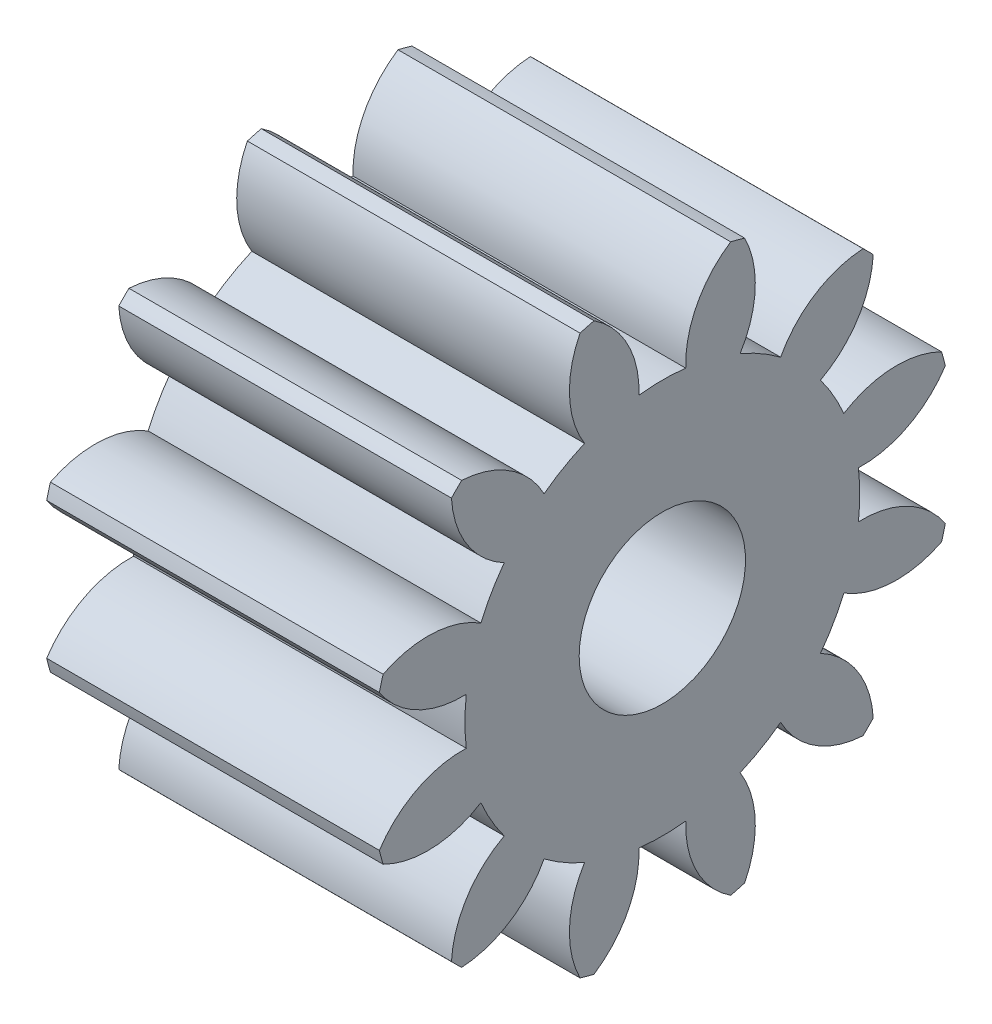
ISO-10303-21;
HEADER;
FILE_DESCRIPTION(('STEP AP214'),'2;1');
FILE_NAME('part.step','',(''),(''),'','','');
FILE_SCHEMA(('AUTOMOTIVE_DESIGN { 1 0 10303 214 1 1 1 1 }'));
ENDSEC;
DATA;
#1=APPLICATION_CONTEXT('core data for automotive mechanical design processes');
#2=APPLICATION_PROTOCOL_DEFINITION('international standard','automotive_design',2000,#1);
#3=PRODUCT_CONTEXT('',#1,'mechanical');
#4=PRODUCT('Part','Part','',(#3));
#5=PRODUCT_RELATED_PRODUCT_CATEGORY('part','',(#4));
#6=PRODUCT_DEFINITION_FORMATION('','',#4);
#7=PRODUCT_DEFINITION_CONTEXT('part definition',#1,'design');
#8=PRODUCT_DEFINITION('design','',#6,#7);
#9=PRODUCT_DEFINITION_SHAPE('','',#8);
#10=(LENGTH_UNIT() NAMED_UNIT(*) SI_UNIT(.MILLI.,.METRE.));
#11=(NAMED_UNIT(*) PLANE_ANGLE_UNIT() SI_UNIT($,.RADIAN.));
#12=(NAMED_UNIT(*) SI_UNIT($,.STERADIAN.) SOLID_ANGLE_UNIT());
#13=UNCERTAINTY_MEASURE_WITH_UNIT(LENGTH_MEASURE(1.E-05),#10,'distance_accuracy_value','');
#14=(GEOMETRIC_REPRESENTATION_CONTEXT(3) GLOBAL_UNCERTAINTY_ASSIGNED_CONTEXT((#13)) GLOBAL_UNIT_ASSIGNED_CONTEXT((#10,
#11,#12)) REPRESENTATION_CONTEXT('',''));
#15=CARTESIAN_POINT('',(0.,0.,0.));
#16=DIRECTION('',(0.,0.,1.));
#17=DIRECTION('',(1.,0.,0.));
#18=AXIS2_PLACEMENT_3D('',#15,#16,#17);
#19=CARTESIAN_POINT('',(4.,0.,0.));
#20=DIRECTION('',(-1.,0.,0.));
#21=DIRECTION('',(0.,0.,1.));
#22=AXIS2_PLACEMENT_3D('',#19,#20,#21);
#23=PLANE('',#22);
#24=CARTESIAN_POINT('',(4.,1.33747692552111,-2.4816034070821));
#25=DIRECTION('',(-1.,0.,0.));
#26=DIRECTION('',(0.,-0.499999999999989,-0.866025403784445));
#27=AXIS2_PLACEMENT_3D('',#24,#25,#26);
#28=CIRCLE('',#27,1.2);
#29=CARTESIAN_POINT('',(4.,1.90091808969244,-1.42210633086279));
#30=VERTEX_POINT('',#29);
#31=CARTESIAN_POINT('',(4.,2.53549858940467,-2.41272603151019));
#32=VERTEX_POINT('',#31);
#33=EDGE_CURVE('E347',#30,#32,#28,.T.);
#34=ORIENTED_EDGE('',*,*,#33,.F.);
#35=CARTESIAN_POINT('',(4.,0.,0.));
#36=DIRECTION('',(-1.,0.,0.));
#37=DIRECTION('',(0.,-0.499999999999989,-0.866025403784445));
#38=AXIS2_PLACEMENT_3D('',#35,#36,#37);
#39=CIRCLE('',#38,2.374);
#40=CARTESIAN_POINT('',(4.,2.1820392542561,-0.935190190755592));
#41=VERTEX_POINT('',#40);
#42=EDGE_CURVE('E346',#41,#30,#39,.T.);
#43=ORIENTED_EDGE('',*,*,#42,.F.);
#44=CARTESIAN_POINT('',(4.,2.81787005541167,0.0825127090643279));
#45=DIRECTION('',(-1.,0.,0.));
#46=DIRECTION('',(0.,-0.499999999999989,-0.866025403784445));
#47=AXIS2_PLACEMENT_3D('',#44,#45,#46);
#48=CIRCLE('',#47,1.2);
#49=CARTESIAN_POINT('',(4.,3.3572313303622,-0.989443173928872));
#50=VERTEX_POINT('',#49);
#51=EDGE_CURVE('E335',#50,#41,#48,.T.);
#52=ORIENTED_EDGE('',*,*,#51,.F.);
#53=CARTESIAN_POINT('',(4.,0.,0.));
#54=DIRECTION('',(-1.,0.,0.));
#55=DIRECTION('',(0.,0.,1.));
#56=AXIS2_PLACEMENT_3D('',#53,#54,#55);
#57=CIRCLE('',#56,3.5);
#58=CARTESIAN_POINT('',(4.,3.40216920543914,-0.821732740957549));
#59=VERTEX_POINT('',#58);
#60=EDGE_CURVE('E614',#59,#50,#57,.T.);
#61=ORIENTED_EDGE('',*,*,#60,.F.);
#62=CARTESIAN_POINT('',(4.,2.39909069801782,-1.48039312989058));
#63=DIRECTION('',(-1.,0.,0.));
#64=DIRECTION('',(0.,0.,-1.));
#65=AXIS2_PLACEMENT_3D('',#62,#63,#64);
#66=CIRCLE('',#65,1.2);
#67=CARTESIAN_POINT('',(4.,2.35729652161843,-0.281121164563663));
#68=VERTEX_POINT('',#67);
#69=EDGE_CURVE('E587',#68,#59,#66,.T.);
#70=ORIENTED_EDGE('',*,*,#69,.F.);
#71=CARTESIAN_POINT('',(4.,0.,0.));
#72=DIRECTION('',(-1.,0.,0.));
#73=DIRECTION('',(0.,0.,-1.));
#74=AXIS2_PLACEMENT_3D('',#71,#72,#73);
#75=CIRCLE('',#74,2.374);
#76=CARTESIAN_POINT('',(4.,2.35729652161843,0.281121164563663));
#77=VERTEX_POINT('',#76);
#78=EDGE_CURVE('E592',#77,#68,#75,.T.);
#79=ORIENTED_EDGE('',*,*,#78,.F.);
#80=CARTESIAN_POINT('',(4.,2.39909069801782,1.48039312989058));
#81=DIRECTION('',(-1.,0.,0.));
#82=DIRECTION('',(0.,0.,-1.));
#83=AXIS2_PLACEMENT_3D('',#80,#81,#82);
#84=CIRCLE('',#83,1.2);
#85=CARTESIAN_POINT('',(4.,3.40216920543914,0.821732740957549));
#86=VERTEX_POINT('',#85);
#87=EDGE_CURVE('E589',#86,#77,#84,.T.);
#88=ORIENTED_EDGE('',*,*,#87,.F.);
#89=CARTESIAN_POINT('',(4.,3.35723133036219,0.989443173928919));
#90=VERTEX_POINT('',#89);
#91=EDGE_CURVE('E612',#90,#86,#57,.T.);
#92=ORIENTED_EDGE('',*,*,#91,.F.);
#93=CARTESIAN_POINT('',(4.,2.81787005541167,-0.0825127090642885));
#94=DIRECTION('',(-1.,0.,0.));
#95=DIRECTION('',(0.,0.500000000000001,-0.866025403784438));
#96=AXIS2_PLACEMENT_3D('',#93,#94,#95);
#97=CIRCLE('',#96,1.2);
#98=CARTESIAN_POINT('',(4.,2.18203925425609,0.935190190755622));
#99=VERTEX_POINT('',#98);
#100=EDGE_CURVE('E565',#99,#90,#97,.T.);
#101=ORIENTED_EDGE('',*,*,#100,.F.);
#102=CARTESIAN_POINT('',(4.,0.,0.));
#103=DIRECTION('',(-1.,0.,0.));
#104=DIRECTION('',(0.,0.500000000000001,-0.866025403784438));
#105=AXIS2_PLACEMENT_3D('',#102,#103,#104);
#106=CIRCLE('',#105,2.374);
#107=CARTESIAN_POINT('',(4.,1.90091808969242,1.42210633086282));
#108=VERTEX_POINT('',#107);
#109=EDGE_CURVE('E570',#108,#99,#106,.T.);
#110=ORIENTED_EDGE('',*,*,#109,.F.);
#111=CARTESIAN_POINT('',(4.,1.33747692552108,2.48160340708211));
#112=DIRECTION('',(-1.,0.,0.));
#113=DIRECTION('',(0.,0.500000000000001,-0.866025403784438));
#114=AXIS2_PLACEMENT_3D('',#111,#112,#113);
#115=CIRCLE('',#114,1.2);
#116=CARTESIAN_POINT('',(4.,2.53549858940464,2.41272603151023));
#117=VERTEX_POINT('',#116);
#118=EDGE_CURVE('E567',#117,#108,#115,.T.);
#119=ORIENTED_EDGE('',*,*,#118,.F.);
#120=CARTESIAN_POINT('',(4.,2.41272603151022,2.53549858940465));
#121=VERTEX_POINT('',#120);
#122=EDGE_CURVE('E696',#121,#117,#57,.T.);
#123=ORIENTED_EDGE('',*,*,#122,.F.);
#124=CARTESIAN_POINT('',(4.,2.48160340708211,1.33747692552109));
#125=DIRECTION('',(-1.,0.,0.));
#126=DIRECTION('',(0.,0.86602540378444,-0.499999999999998));
#127=AXIS2_PLACEMENT_3D('',#124,#125,#126);
#128=CIRCLE('',#127,1.2);
#129=CARTESIAN_POINT('',(4.,1.42210633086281,1.90091808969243));
#130=VERTEX_POINT('',#129);
#131=EDGE_CURVE('E543',#130,#121,#128,.T.);
#132=ORIENTED_EDGE('',*,*,#131,.F.);
#133=CARTESIAN_POINT('',(4.,0.,0.));
#134=DIRECTION('',(-1.,0.,0.));
#135=DIRECTION('',(0.,0.86602540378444,-0.499999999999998));
#136=AXIS2_PLACEMENT_3D('',#133,#134,#135);
#137=CIRCLE('',#136,2.374);
#138=CARTESIAN_POINT('',(4.,0.935190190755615,2.18203925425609));
#139=VERTEX_POINT('',#138);
#140=EDGE_CURVE('E548',#139,#130,#137,.T.);
#141=ORIENTED_EDGE('',*,*,#140,.F.);
#142=CARTESIAN_POINT('',(4.,-0.0825127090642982,2.81787005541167));
#143=DIRECTION('',(-1.,0.,0.));
#144=DIRECTION('',(0.,0.86602540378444,-0.499999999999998));
#145=AXIS2_PLACEMENT_3D('',#142,#143,#144);
#146=CIRCLE('',#145,1.2);
#147=CARTESIAN_POINT('',(4.,0.989443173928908,3.35723133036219));
#148=VERTEX_POINT('',#147);
#149=EDGE_CURVE('E545',#148,#139,#146,.T.);
#150=ORIENTED_EDGE('',*,*,#149,.F.);
#151=CARTESIAN_POINT('',(4.,0.821732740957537,3.40216920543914));
#152=VERTEX_POINT('',#151);
#153=EDGE_CURVE('E691',#152,#148,#57,.T.);
#154=ORIENTED_EDGE('',*,*,#153,.F.);
#155=CARTESIAN_POINT('',(4.,1.48039312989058,2.39909069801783));
#156=DIRECTION('',(-1.,0.,0.));
#157=DIRECTION('',(0.,1.,0.));
#158=AXIS2_PLACEMENT_3D('',#155,#156,#157);
#159=CIRCLE('',#158,1.2);
#160=CARTESIAN_POINT('',(4.,0.281121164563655,2.35729652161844));
#161=VERTEX_POINT('',#160);
#162=EDGE_CURVE('E521',#161,#152,#159,.T.);
#163=ORIENTED_EDGE('',*,*,#162,.F.);
#164=CARTESIAN_POINT('',(4.,0.,0.));
#165=DIRECTION('',(-1.,0.,0.));
#166=DIRECTION('',(0.,1.,0.));
#167=AXIS2_PLACEMENT_3D('',#164,#165,#166);
#168=CIRCLE('',#167,2.374);
#169=CARTESIAN_POINT('',(4.,-0.281121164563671,2.35729652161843));
#170=VERTEX_POINT('',#169);
#171=EDGE_CURVE('E526',#170,#161,#168,.T.);
#172=ORIENTED_EDGE('',*,*,#171,.F.);
#173=CARTESIAN_POINT('',(4.,-1.48039312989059,2.39909069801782));
#174=DIRECTION('',(-1.,0.,0.));
#175=DIRECTION('',(0.,1.,0.));
#176=AXIS2_PLACEMENT_3D('',#173,#174,#175);
#177=CIRCLE('',#176,1.2);
#178=CARTESIAN_POINT('',(4.,-0.821732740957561,3.40216920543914));
#179=VERTEX_POINT('',#178);
#180=EDGE_CURVE('E523',#179,#170,#177,.T.);
#181=ORIENTED_EDGE('',*,*,#180,.F.);
#182=CARTESIAN_POINT('',(4.,-0.989443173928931,3.35723133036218));
#183=VERTEX_POINT('',#182);
#184=EDGE_CURVE('E686',#183,#179,#57,.T.);
#185=ORIENTED_EDGE('',*,*,#184,.F.);
#186=CARTESIAN_POINT('',(4.,0.0825127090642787,2.81787005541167));
#187=DIRECTION('',(-1.,0.,0.));
#188=DIRECTION('',(0.,0.866025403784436,0.500000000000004));
#189=AXIS2_PLACEMENT_3D('',#186,#187,#188);
#190=CIRCLE('',#189,1.2);
#191=CARTESIAN_POINT('',(4.,-0.93519019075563,2.18203925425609));
#192=VERTEX_POINT('',#191);
#193=EDGE_CURVE('E499',#192,#183,#190,.T.);
#194=ORIENTED_EDGE('',*,*,#193,.F.);
#195=CARTESIAN_POINT('',(4.,0.,0.));
#196=DIRECTION('',(-1.,0.,0.));
#197=DIRECTION('',(0.,0.866025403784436,0.500000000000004));
#198=AXIS2_PLACEMENT_3D('',#195,#196,#197);
#199=CIRCLE('',#198,2.374);
#200=CARTESIAN_POINT('',(4.,-1.42210633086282,1.90091808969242));
#201=VERTEX_POINT('',#200);
#202=EDGE_CURVE('E504',#201,#192,#199,.T.);
#203=ORIENTED_EDGE('',*,*,#202,.F.);
#204=CARTESIAN_POINT('',(4.,-2.48160340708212,1.33747692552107));
#205=DIRECTION('',(-1.,0.,0.));
#206=DIRECTION('',(0.,0.866025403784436,0.500000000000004));
#207=AXIS2_PLACEMENT_3D('',#204,#205,#206);
#208=CIRCLE('',#207,1.2);
#209=CARTESIAN_POINT('',(4.,-2.41272603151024,2.53549858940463));
#210=VERTEX_POINT('',#209);
#211=EDGE_CURVE('E501',#210,#201,#208,.T.);
#212=ORIENTED_EDGE('',*,*,#211,.F.);
#213=CARTESIAN_POINT('',(4.,-2.53549858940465,2.41272603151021));
#214=VERTEX_POINT('',#213);
#215=EDGE_CURVE('E681',#214,#210,#57,.T.);
#216=ORIENTED_EDGE('',*,*,#215,.F.);
#217=CARTESIAN_POINT('',(4.,-1.3374769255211,2.4816034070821));
#218=DIRECTION('',(-1.,0.,0.));
#219=DIRECTION('',(0.,0.499999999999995,0.866025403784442));
#220=AXIS2_PLACEMENT_3D('',#217,#218,#219);
#221=CIRCLE('',#220,1.2);
#222=CARTESIAN_POINT('',(4.,-1.90091808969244,1.4221063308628));
#223=VERTEX_POINT('',#222);
#224=EDGE_CURVE('E477',#223,#214,#221,.T.);
#225=ORIENTED_EDGE('',*,*,#224,.F.);
#226=CARTESIAN_POINT('',(4.,0.,0.));
#227=DIRECTION('',(-1.,0.,0.));
#228=DIRECTION('',(0.,0.499999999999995,0.866025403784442));
#229=AXIS2_PLACEMENT_3D('',#226,#227,#228);
#230=CIRCLE('',#229,2.374);
#231=CARTESIAN_POINT('',(4.,-2.18203925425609,0.935190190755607));
#232=VERTEX_POINT('',#231);
#233=EDGE_CURVE('E482',#232,#223,#230,.T.);
#234=ORIENTED_EDGE('',*,*,#233,.F.);
#235=CARTESIAN_POINT('',(4.,-2.81787005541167,-0.0825127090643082));
#236=DIRECTION('',(-1.,0.,0.));
#237=DIRECTION('',(0.,0.499999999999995,0.866025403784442));
#238=AXIS2_PLACEMENT_3D('',#235,#236,#237);
#239=CIRCLE('',#238,1.2);
#240=CARTESIAN_POINT('',(4.,-3.35723133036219,0.989443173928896));
#241=VERTEX_POINT('',#240);
#242=EDGE_CURVE('E479',#241,#232,#239,.T.);
#243=ORIENTED_EDGE('',*,*,#242,.F.);
#244=CARTESIAN_POINT('',(4.,-3.40216920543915,0.821732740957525));
#245=VERTEX_POINT('',#244);
#246=EDGE_CURVE('E676',#245,#241,#57,.T.);
#247=ORIENTED_EDGE('',*,*,#246,.F.);
#248=CARTESIAN_POINT('',(4.,-2.39909069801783,1.48039312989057));
#249=DIRECTION('',(-1.,0.,0.));
#250=DIRECTION('',(0.,0.,1.));
#251=AXIS2_PLACEMENT_3D('',#248,#249,#250);
#252=CIRCLE('',#251,1.2);
#253=CARTESIAN_POINT('',(4.,-2.35729652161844,0.281121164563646));
#254=VERTEX_POINT('',#253);
#255=EDGE_CURVE('E455',#254,#245,#252,.T.);
#256=ORIENTED_EDGE('',*,*,#255,.F.);
#257=CARTESIAN_POINT('',(4.,0.,0.));
#258=DIRECTION('',(-1.,0.,0.));
#259=DIRECTION('',(0.,0.,1.));
#260=AXIS2_PLACEMENT_3D('',#257,#258,#259);
#261=CIRCLE('',#260,2.374);
#262=CARTESIAN_POINT('',(4.,-2.35729652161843,-0.281121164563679));
#263=VERTEX_POINT('',#262);
#264=EDGE_CURVE('E460',#263,#254,#261,.T.);
#265=ORIENTED_EDGE('',*,*,#264,.F.);
#266=CARTESIAN_POINT('',(4.,-2.39909069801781,-1.4803931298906));
#267=DIRECTION('',(-1.,0.,0.));
#268=DIRECTION('',(0.,0.,1.));
#269=AXIS2_PLACEMENT_3D('',#266,#267,#268);
#270=CIRCLE('',#269,1.2);
#271=CARTESIAN_POINT('',(4.,-3.40216920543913,-0.821732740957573));
#272=VERTEX_POINT('',#271);
#273=EDGE_CURVE('E457',#272,#263,#270,.T.);
#274=ORIENTED_EDGE('',*,*,#273,.F.);
#275=CARTESIAN_POINT('',(4.,-3.35723133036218,-0.989443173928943));
#276=VERTEX_POINT('',#275);
#277=EDGE_CURVE('E671',#276,#272,#57,.T.);
#278=ORIENTED_EDGE('',*,*,#277,.F.);
#279=CARTESIAN_POINT('',(4.,-2.81787005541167,0.0825127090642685));
#280=DIRECTION('',(-1.,0.,0.));
#281=DIRECTION('',(0.,-0.500000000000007,0.866025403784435));
#282=AXIS2_PLACEMENT_3D('',#279,#280,#281);
#283=CIRCLE('',#282,1.2);
#284=CARTESIAN_POINT('',(4.,-2.18203925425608,-0.935190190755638));
#285=VERTEX_POINT('',#284);
#286=EDGE_CURVE('E433',#285,#276,#283,.T.);
#287=ORIENTED_EDGE('',*,*,#286,.F.);
#288=CARTESIAN_POINT('',(4.,0.,0.));
#289=DIRECTION('',(-1.,0.,0.));
#290=DIRECTION('',(0.,-0.500000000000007,0.866025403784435));
#291=AXIS2_PLACEMENT_3D('',#288,#289,#290);
#292=CIRCLE('',#291,2.374);
#293=CARTESIAN_POINT('',(4.,-1.90091808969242,-1.42210633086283));
#294=VERTEX_POINT('',#293);
#295=EDGE_CURVE('E438',#294,#285,#292,.T.);
#296=ORIENTED_EDGE('',*,*,#295,.F.);
#297=CARTESIAN_POINT('',(4.,-1.33747692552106,-2.48160340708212));
#298=DIRECTION('',(-1.,0.,0.));
#299=DIRECTION('',(0.,-0.500000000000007,0.866025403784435));
#300=AXIS2_PLACEMENT_3D('',#297,#298,#299);
#301=CIRCLE('',#300,1.2);
#302=CARTESIAN_POINT('',(4.,-2.53549858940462,-2.41272603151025));
#303=VERTEX_POINT('',#302);
#304=EDGE_CURVE('E435',#303,#294,#301,.T.);
#305=ORIENTED_EDGE('',*,*,#304,.F.);
#306=CARTESIAN_POINT('',(4.,-2.4127260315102,-2.53549858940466));
#307=VERTEX_POINT('',#306);
#308=EDGE_CURVE('E666',#307,#303,#57,.T.);
#309=ORIENTED_EDGE('',*,*,#308,.F.);
#310=CARTESIAN_POINT('',(4.,-2.4816034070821,-1.3374769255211));
#311=DIRECTION('',(-1.,0.,0.));
#312=DIRECTION('',(0.,-0.866025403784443,0.499999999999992));
#313=AXIS2_PLACEMENT_3D('',#310,#311,#312);
#314=CIRCLE('',#313,1.2);
#315=CARTESIAN_POINT('',(4.,-1.4221063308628,-1.90091808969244));
#316=VERTEX_POINT('',#315);
#317=EDGE_CURVE('E411',#316,#307,#314,.T.);
#318=ORIENTED_EDGE('',*,*,#317,.F.);
#319=CARTESIAN_POINT('',(4.,0.,0.));
#320=DIRECTION('',(-1.,0.,0.));
#321=DIRECTION('',(0.,-0.866025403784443,0.499999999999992));
#322=AXIS2_PLACEMENT_3D('',#319,#320,#321);
#323=CIRCLE('',#322,2.374);
#324=CARTESIAN_POINT('',(4.,-0.9351901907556,-2.1820392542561));
#325=VERTEX_POINT('',#324);
#326=EDGE_CURVE('E416',#325,#316,#323,.T.);
#327=ORIENTED_EDGE('',*,*,#326,.F.);
#328=CARTESIAN_POINT('',(4.,0.082512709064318,-2.81787005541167));
#329=DIRECTION('',(-1.,0.,0.));
#330=DIRECTION('',(0.,-0.866025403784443,0.499999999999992));
#331=AXIS2_PLACEMENT_3D('',#328,#329,#330);
#332=CIRCLE('',#331,1.2);
#333=CARTESIAN_POINT('',(4.,-0.989443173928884,-3.3572313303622));
#334=VERTEX_POINT('',#333);
#335=EDGE_CURVE('E413',#334,#325,#332,.T.);
#336=ORIENTED_EDGE('',*,*,#335,.F.);
#337=CARTESIAN_POINT('',(4.,-0.821732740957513,-3.40216920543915));
#338=VERTEX_POINT('',#337);
#339=EDGE_CURVE('E661',#338,#334,#57,.T.);
#340=ORIENTED_EDGE('',*,*,#339,.F.);
#341=CARTESIAN_POINT('',(4.,-1.48039312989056,-2.39909069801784));
#342=DIRECTION('',(-1.,0.,0.));
#343=DIRECTION('',(0.,-1.,0.));
#344=AXIS2_PLACEMENT_3D('',#341,#342,#343);
#345=CIRCLE('',#344,1.2);
#346=CARTESIAN_POINT('',(4.,-0.281121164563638,-2.35729652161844));
#347=VERTEX_POINT('',#346);
#348=EDGE_CURVE('E389',#347,#338,#345,.T.);
#349=ORIENTED_EDGE('',*,*,#348,.F.);
#350=CARTESIAN_POINT('',(4.,0.,0.));
#351=DIRECTION('',(-1.,0.,0.));
#352=DIRECTION('',(0.,-1.,0.));
#353=AXIS2_PLACEMENT_3D('',#350,#351,#352);
#354=CIRCLE('',#353,2.374);
#355=CARTESIAN_POINT('',(4.,0.281121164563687,-2.35729652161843));
#356=VERTEX_POINT('',#355);
#357=EDGE_CURVE('E394',#356,#347,#354,.T.);
#358=ORIENTED_EDGE('',*,*,#357,.F.);
#359=CARTESIAN_POINT('',(4.,1.48039312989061,-2.39909069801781));
#360=DIRECTION('',(-1.,0.,0.));
#361=DIRECTION('',(0.,-1.,0.));
#362=AXIS2_PLACEMENT_3D('',#359,#360,#361);
#363=CIRCLE('',#362,1.2);
#364=CARTESIAN_POINT('',(4.,0.821732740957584,-3.40216920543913));
#365=VERTEX_POINT('',#364);
#366=EDGE_CURVE('E391',#365,#356,#363,.T.);
#367=ORIENTED_EDGE('',*,*,#366,.F.);
#368=CARTESIAN_POINT('',(4.,0.989443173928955,-3.35723133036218));
#369=VERTEX_POINT('',#368);
#370=EDGE_CURVE('E660',#369,#365,#57,.T.);
#371=ORIENTED_EDGE('',*,*,#370,.F.);
#372=CARTESIAN_POINT('',(4.,-0.0825127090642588,-2.81787005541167));
#373=DIRECTION('',(-1.,0.,0.));
#374=DIRECTION('',(0.,-0.866025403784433,-0.50000000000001));
#375=AXIS2_PLACEMENT_3D('',#372,#373,#374);
#376=CIRCLE('',#375,1.2);
#377=CARTESIAN_POINT('',(4.,0.935190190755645,-2.18203925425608));
#378=VERTEX_POINT('',#377);
#379=EDGE_CURVE('E369',#378,#369,#376,.T.);
#380=ORIENTED_EDGE('',*,*,#379,.F.);
#381=CARTESIAN_POINT('',(4.,0.,0.));
#382=DIRECTION('',(-1.,0.,0.));
#383=DIRECTION('',(0.,-0.866025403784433,-0.50000000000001));
#384=AXIS2_PLACEMENT_3D('',#381,#382,#383);
#385=CIRCLE('',#384,2.374);
#386=CARTESIAN_POINT('',(4.,1.42210633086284,-1.90091808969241));
#387=VERTEX_POINT('',#386);
#388=EDGE_CURVE('E374',#387,#378,#385,.T.);
#389=ORIENTED_EDGE('',*,*,#388,.F.);
#390=CARTESIAN_POINT('',(4.,2.48160340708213,-1.33747692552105));
#391=DIRECTION('',(-1.,0.,0.));
#392=DIRECTION('',(0.,-0.866025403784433,-0.50000000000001));
#393=AXIS2_PLACEMENT_3D('',#390,#391,#392);
#394=CIRCLE('',#393,1.2);
#395=CARTESIAN_POINT('',(4.,2.41272603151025,-2.53549858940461));
#396=VERTEX_POINT('',#395);
#397=EDGE_CURVE('E371',#396,#387,#394,.T.);
#398=ORIENTED_EDGE('',*,*,#397,.F.);
#399=EDGE_CURVE('E617',#32,#396,#57,.T.);
#400=ORIENTED_EDGE('',*,*,#399,.F.);
#401=EDGE_LOOP('',(#34,#43,#52,#61,#70,#79,#88,#92,#101,#110,#119,#123,#132,#141,#150,#154,#163,
#172,#181,#185,#194,#203,#212,#216,#225,#234,#243,#247,#256,#265,#274,#278,#287,#296,#305,#309,
#318,#327,#336,#340,#349,#358,#367,#371,#380,#389,#398,#400));
#402=FACE_BOUND('',#401,.T.);
#403=CARTESIAN_POINT('',(4.,0.,0.));
#404=DIRECTION('',(-1.,0.,0.));
#405=DIRECTION('',(0.,0.,1.));
#406=AXIS2_PLACEMENT_3D('',#403,#404,#405);
#407=CIRCLE('',#406,1.);
#408=CARTESIAN_POINT('',(4.,0.,1.));
#409=VERTEX_POINT('',#408);
#410=EDGE_CURVE('E364',#409,#409,#407,.F.);
#411=ORIENTED_EDGE('',*,*,#410,.F.);
#412=EDGE_LOOP('',(#411));
#413=FACE_BOUND('',#412,.T.);
#414=ADVANCED_FACE('F30',(#402,#413),#23,.F.);
#415=CARTESIAN_POINT('',(0.,0.,0.));
#416=DIRECTION('',(1.,0.,0.));
#417=DIRECTION('',(0.,0.,-1.));
#418=AXIS2_PLACEMENT_3D('',#415,#416,#417);
#419=PLANE('',#418);
#420=CARTESIAN_POINT('',(0.,1.33747692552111,-2.4816034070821));
#421=DIRECTION('',(-1.,0.,0.));
#422=DIRECTION('',(0.,-0.499999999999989,-0.866025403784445));
#423=AXIS2_PLACEMENT_3D('',#420,#421,#422);
#424=CIRCLE('',#423,1.2);
#425=CARTESIAN_POINT('',(0.,1.90091808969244,-1.42210633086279));
#426=VERTEX_POINT('',#425);
#427=CARTESIAN_POINT('',(0.,2.53549858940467,-2.41272603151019));
#428=VERTEX_POINT('',#427);
#429=EDGE_CURVE('E45',#426,#428,#424,.T.);
#430=ORIENTED_EDGE('',*,*,#429,.T.);
#431=CARTESIAN_POINT('',(0.,0.,0.));
#432=DIRECTION('',(-1.,0.,0.));
#433=DIRECTION('',(0.,0.,1.));
#434=AXIS2_PLACEMENT_3D('',#431,#432,#433);
#435=CIRCLE('',#434,3.5);
#436=CARTESIAN_POINT('',(0.,2.41272603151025,-2.53549858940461));
#437=VERTEX_POINT('',#436);
#438=EDGE_CURVE('E613',#428,#437,#435,.T.);
#439=ORIENTED_EDGE('',*,*,#438,.T.);
#440=CARTESIAN_POINT('',(0.,2.48160340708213,-1.33747692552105));
#441=DIRECTION('',(1.,0.,0.));
#442=DIRECTION('',(0.,0.,-1.));
#443=AXIS2_PLACEMENT_3D('',#440,#441,#442);
#444=CIRCLE('',#443,1.2);
#445=CARTESIAN_POINT('',(0.,1.42210633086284,-1.90091808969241));
#446=VERTEX_POINT('',#445);
#447=EDGE_CURVE('E38',#446,#437,#444,.T.);
#448=ORIENTED_EDGE('',*,*,#447,.F.);
#449=CARTESIAN_POINT('',(0.,0.,0.));
#450=DIRECTION('',(-1.,0.,0.));
#451=DIRECTION('',(0.,-0.866025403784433,-0.50000000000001));
#452=AXIS2_PLACEMENT_3D('',#449,#450,#451);
#453=CIRCLE('',#452,2.374);
#454=CARTESIAN_POINT('',(0.,0.935190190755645,-2.18203925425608));
#455=VERTEX_POINT('',#454);
#456=EDGE_CURVE('E372',#446,#455,#453,.T.);
#457=ORIENTED_EDGE('',*,*,#456,.T.);
#458=CARTESIAN_POINT('',(0.,-0.0825127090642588,-2.81787005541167));
#459=DIRECTION('',(-1.,0.,0.));
#460=DIRECTION('',(0.,-0.866025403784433,-0.50000000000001));
#461=AXIS2_PLACEMENT_3D('',#458,#459,#460);
#462=CIRCLE('',#461,1.2);
#463=CARTESIAN_POINT('',(0.,0.989443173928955,-3.35723133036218));
#464=VERTEX_POINT('',#463);
#465=EDGE_CURVE('E53',#455,#464,#462,.T.);
#466=ORIENTED_EDGE('',*,*,#465,.T.);
#467=CARTESIAN_POINT('',(0.,0.821732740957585,-3.40216920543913));
#468=VERTEX_POINT('',#467);
#469=EDGE_CURVE('E887',#464,#468,#435,.T.);
#470=ORIENTED_EDGE('',*,*,#469,.T.);
#471=CARTESIAN_POINT('',(0.,1.48039312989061,-2.39909069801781));
#472=DIRECTION('',(1.,0.,0.));
#473=DIRECTION('',(0.,0.,-1.));
#474=AXIS2_PLACEMENT_3D('',#471,#472,#473);
#475=CIRCLE('',#474,1.2);
#476=CARTESIAN_POINT('',(0.,0.281121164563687,-2.35729652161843));
#477=VERTEX_POINT('',#476);
#478=EDGE_CURVE('E644',#477,#468,#475,.T.);
#479=ORIENTED_EDGE('',*,*,#478,.F.);
#480=CARTESIAN_POINT('',(0.,0.,0.));
#481=DIRECTION('',(-1.,0.,0.));
#482=DIRECTION('',(0.,-1.,0.));
#483=AXIS2_PLACEMENT_3D('',#480,#481,#482);
#484=CIRCLE('',#483,2.374);
#485=CARTESIAN_POINT('',(0.,-0.281121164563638,-2.35729652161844));
#486=VERTEX_POINT('',#485);
#487=EDGE_CURVE('E392',#477,#486,#484,.T.);
#488=ORIENTED_EDGE('',*,*,#487,.T.);
#489=CARTESIAN_POINT('',(0.,-1.48039312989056,-2.39909069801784));
#490=DIRECTION('',(-1.,0.,0.));
#491=DIRECTION('',(0.,-1.,0.));
#492=AXIS2_PLACEMENT_3D('',#489,#490,#491);
#493=CIRCLE('',#492,1.2);
#494=CARTESIAN_POINT('',(0.,-0.821732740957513,-3.40216920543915));
#495=VERTEX_POINT('',#494);
#496=EDGE_CURVE('E388',#486,#495,#493,.T.);
#497=ORIENTED_EDGE('',*,*,#496,.T.);
#498=CARTESIAN_POINT('',(0.,-0.989443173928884,-3.3572313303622));
#499=VERTEX_POINT('',#498);
#500=EDGE_CURVE('E888',#495,#499,#435,.T.);
#501=ORIENTED_EDGE('',*,*,#500,.T.);
#502=CARTESIAN_POINT('',(0.,0.082512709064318,-2.81787005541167));
#503=DIRECTION('',(1.,0.,0.));
#504=DIRECTION('',(0.,0.,-1.));
#505=AXIS2_PLACEMENT_3D('',#502,#503,#504);
#506=CIRCLE('',#505,1.2);
#507=CARTESIAN_POINT('',(0.,-0.9351901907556,-2.1820392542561));
#508=VERTEX_POINT('',#507);
#509=EDGE_CURVE('E641',#508,#499,#506,.T.);
#510=ORIENTED_EDGE('',*,*,#509,.F.);
#511=CARTESIAN_POINT('',(0.,0.,0.));
#512=DIRECTION('',(-1.,0.,0.));
#513=DIRECTION('',(0.,-0.866025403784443,0.499999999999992));
#514=AXIS2_PLACEMENT_3D('',#511,#512,#513);
#515=CIRCLE('',#514,2.374);
#516=CARTESIAN_POINT('',(0.,-1.4221063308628,-1.90091808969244));
#517=VERTEX_POINT('',#516);
#518=EDGE_CURVE('E414',#508,#517,#515,.T.);
#519=ORIENTED_EDGE('',*,*,#518,.T.);
#520=CARTESIAN_POINT('',(0.,-2.4816034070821,-1.3374769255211));
#521=DIRECTION('',(-1.,0.,0.));
#522=DIRECTION('',(0.,-0.866025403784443,0.499999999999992));
#523=AXIS2_PLACEMENT_3D('',#520,#521,#522);
#524=CIRCLE('',#523,1.2);
#525=CARTESIAN_POINT('',(0.,-2.4127260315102,-2.53549858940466));
#526=VERTEX_POINT('',#525);
#527=EDGE_CURVE('E410',#517,#526,#524,.T.);
#528=ORIENTED_EDGE('',*,*,#527,.T.);
#529=CARTESIAN_POINT('',(0.,-2.53549858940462,-2.41272603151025));
#530=VERTEX_POINT('',#529);
#531=EDGE_CURVE('E891',#526,#530,#435,.T.);
#532=ORIENTED_EDGE('',*,*,#531,.T.);
#533=CARTESIAN_POINT('',(0.,-1.33747692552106,-2.48160340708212));
#534=DIRECTION('',(1.,0.,0.));
#535=DIRECTION('',(0.,0.,-1.));
#536=AXIS2_PLACEMENT_3D('',#533,#534,#535);
#537=CIRCLE('',#536,1.2);
#538=CARTESIAN_POINT('',(0.,-1.90091808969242,-1.42210633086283));
#539=VERTEX_POINT('',#538);
#540=EDGE_CURVE('E638',#539,#530,#537,.T.);
#541=ORIENTED_EDGE('',*,*,#540,.F.);
#542=CARTESIAN_POINT('',(0.,0.,0.));
#543=DIRECTION('',(-1.,0.,0.));
#544=DIRECTION('',(0.,-0.500000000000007,0.866025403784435));
#545=AXIS2_PLACEMENT_3D('',#542,#543,#544);
#546=CIRCLE('',#545,2.374);
#547=CARTESIAN_POINT('',(0.,-2.18203925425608,-0.935190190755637));
#548=VERTEX_POINT('',#547);
#549=EDGE_CURVE('E436',#539,#548,#546,.T.);
#550=ORIENTED_EDGE('',*,*,#549,.T.);
#551=CARTESIAN_POINT('',(0.,-2.81787005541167,0.0825127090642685));
#552=DIRECTION('',(-1.,0.,0.));
#553=DIRECTION('',(0.,-0.500000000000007,0.866025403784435));
#554=AXIS2_PLACEMENT_3D('',#551,#552,#553);
#555=CIRCLE('',#554,1.2);
#556=CARTESIAN_POINT('',(0.,-3.35723133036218,-0.989443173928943));
#557=VERTEX_POINT('',#556);
#558=EDGE_CURVE('E432',#548,#557,#555,.T.);
#559=ORIENTED_EDGE('',*,*,#558,.T.);
#560=CARTESIAN_POINT('',(0.,-3.40216920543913,-0.821732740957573));
#561=VERTEX_POINT('',#560);
#562=EDGE_CURVE('E894',#557,#561,#435,.T.);
#563=ORIENTED_EDGE('',*,*,#562,.T.);
#564=CARTESIAN_POINT('',(0.,-2.39909069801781,-1.4803931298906));
#565=DIRECTION('',(1.,0.,0.));
#566=DIRECTION('',(0.,0.,-1.));
#567=AXIS2_PLACEMENT_3D('',#564,#565,#566);
#568=CIRCLE('',#567,1.2);
#569=CARTESIAN_POINT('',(0.,-2.35729652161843,-0.281121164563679));
#570=VERTEX_POINT('',#569);
#571=EDGE_CURVE('E635',#570,#561,#568,.T.);
#572=ORIENTED_EDGE('',*,*,#571,.F.);
#573=CARTESIAN_POINT('',(0.,0.,0.));
#574=DIRECTION('',(-1.,0.,0.));
#575=DIRECTION('',(0.,0.,1.));
#576=AXIS2_PLACEMENT_3D('',#573,#574,#575);
#577=CIRCLE('',#576,2.374);
#578=CARTESIAN_POINT('',(0.,-2.35729652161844,0.281121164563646));
#579=VERTEX_POINT('',#578);
#580=EDGE_CURVE('E458',#570,#579,#577,.T.);
#581=ORIENTED_EDGE('',*,*,#580,.T.);
#582=CARTESIAN_POINT('',(0.,-2.39909069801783,1.48039312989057));
#583=DIRECTION('',(-1.,0.,0.));
#584=DIRECTION('',(0.,0.,1.));
#585=AXIS2_PLACEMENT_3D('',#582,#583,#584);
#586=CIRCLE('',#585,1.2);
#587=CARTESIAN_POINT('',(0.,-3.40216920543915,0.821732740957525));
#588=VERTEX_POINT('',#587);
#589=EDGE_CURVE('E454',#579,#588,#586,.T.);
#590=ORIENTED_EDGE('',*,*,#589,.T.);
#591=CARTESIAN_POINT('',(0.,-3.35723133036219,0.989443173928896));
#592=VERTEX_POINT('',#591);
#593=EDGE_CURVE('E897',#588,#592,#435,.T.);
#594=ORIENTED_EDGE('',*,*,#593,.T.);
#595=CARTESIAN_POINT('',(0.,-2.81787005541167,-0.0825127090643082));
#596=DIRECTION('',(1.,0.,0.));
#597=DIRECTION('',(0.,0.,-1.));
#598=AXIS2_PLACEMENT_3D('',#595,#596,#597);
#599=CIRCLE('',#598,1.2);
#600=CARTESIAN_POINT('',(0.,-2.18203925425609,0.935190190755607));
#601=VERTEX_POINT('',#600);
#602=EDGE_CURVE('E632',#601,#592,#599,.T.);
#603=ORIENTED_EDGE('',*,*,#602,.F.);
#604=CARTESIAN_POINT('',(0.,0.,0.));
#605=DIRECTION('',(-1.,0.,0.));
#606=DIRECTION('',(0.,0.499999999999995,0.866025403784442));
#607=AXIS2_PLACEMENT_3D('',#604,#605,#606);
#608=CIRCLE('',#607,2.374);
#609=CARTESIAN_POINT('',(0.,-1.90091808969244,1.4221063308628));
#610=VERTEX_POINT('',#609);
#611=EDGE_CURVE('E480',#601,#610,#608,.T.);
#612=ORIENTED_EDGE('',*,*,#611,.T.);
#613=CARTESIAN_POINT('',(0.,-1.3374769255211,2.4816034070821));
#614=DIRECTION('',(-1.,0.,0.));
#615=DIRECTION('',(0.,0.499999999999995,0.866025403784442));
#616=AXIS2_PLACEMENT_3D('',#613,#614,#615);
#617=CIRCLE('',#616,1.2);
#618=CARTESIAN_POINT('',(0.,-2.53549858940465,2.41272603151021));
#619=VERTEX_POINT('',#618);
#620=EDGE_CURVE('E476',#610,#619,#617,.T.);
#621=ORIENTED_EDGE('',*,*,#620,.T.);
#622=CARTESIAN_POINT('',(0.,-2.41272603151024,2.53549858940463));
#623=VERTEX_POINT('',#622);
#624=EDGE_CURVE('E900',#619,#623,#435,.T.);
#625=ORIENTED_EDGE('',*,*,#624,.T.);
#626=CARTESIAN_POINT('',(0.,-2.48160340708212,1.33747692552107));
#627=DIRECTION('',(1.,0.,0.));
#628=DIRECTION('',(0.,0.,-1.));
#629=AXIS2_PLACEMENT_3D('',#626,#627,#628);
#630=CIRCLE('',#629,1.2);
#631=CARTESIAN_POINT('',(0.,-1.42210633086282,1.90091808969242));
#632=VERTEX_POINT('',#631);
#633=EDGE_CURVE('E629',#632,#623,#630,.T.);
#634=ORIENTED_EDGE('',*,*,#633,.F.);
#635=CARTESIAN_POINT('',(0.,0.,0.));
#636=DIRECTION('',(-1.,0.,0.));
#637=DIRECTION('',(0.,0.866025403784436,0.500000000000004));
#638=AXIS2_PLACEMENT_3D('',#635,#636,#637);
#639=CIRCLE('',#638,2.374);
#640=CARTESIAN_POINT('',(0.,-0.93519019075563,2.18203925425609));
#641=VERTEX_POINT('',#640);
#642=EDGE_CURVE('E502',#632,#641,#639,.T.);
#643=ORIENTED_EDGE('',*,*,#642,.T.);
#644=CARTESIAN_POINT('',(0.,0.0825127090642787,2.81787005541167));
#645=DIRECTION('',(-1.,0.,0.));
#646=DIRECTION('',(0.,0.866025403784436,0.500000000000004));
#647=AXIS2_PLACEMENT_3D('',#644,#645,#646);
#648=CIRCLE('',#647,1.2);
#649=CARTESIAN_POINT('',(0.,-0.989443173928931,3.35723133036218));
#650=VERTEX_POINT('',#649);
#651=EDGE_CURVE('E498',#641,#650,#648,.T.);
#652=ORIENTED_EDGE('',*,*,#651,.T.);
#653=CARTESIAN_POINT('',(0.,-0.821732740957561,3.40216920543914));
#654=VERTEX_POINT('',#653);
#655=EDGE_CURVE('E903',#650,#654,#435,.T.);
#656=ORIENTED_EDGE('',*,*,#655,.T.);
#657=CARTESIAN_POINT('',(0.,-1.48039312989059,2.39909069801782));
#658=DIRECTION('',(1.,0.,0.));
#659=DIRECTION('',(0.,0.,-1.));
#660=AXIS2_PLACEMENT_3D('',#657,#658,#659);
#661=CIRCLE('',#660,1.2);
#662=CARTESIAN_POINT('',(0.,-0.281121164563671,2.35729652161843));
#663=VERTEX_POINT('',#662);
#664=EDGE_CURVE('E626',#663,#654,#661,.T.);
#665=ORIENTED_EDGE('',*,*,#664,.F.);
#666=CARTESIAN_POINT('',(0.,0.,0.));
#667=DIRECTION('',(-1.,0.,0.));
#668=DIRECTION('',(0.,1.,0.));
#669=AXIS2_PLACEMENT_3D('',#666,#667,#668);
#670=CIRCLE('',#669,2.374);
#671=CARTESIAN_POINT('',(0.,0.281121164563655,2.35729652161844));
#672=VERTEX_POINT('',#671);
#673=EDGE_CURVE('E524',#663,#672,#670,.T.);
#674=ORIENTED_EDGE('',*,*,#673,.T.);
#675=CARTESIAN_POINT('',(0.,1.48039312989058,2.39909069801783));
#676=DIRECTION('',(-1.,0.,0.));
#677=DIRECTION('',(0.,1.,0.));
#678=AXIS2_PLACEMENT_3D('',#675,#676,#677);
#679=CIRCLE('',#678,1.2);
#680=CARTESIAN_POINT('',(0.,0.821732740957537,3.40216920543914));
#681=VERTEX_POINT('',#680);
#682=EDGE_CURVE('E520',#672,#681,#679,.T.);
#683=ORIENTED_EDGE('',*,*,#682,.T.);
#684=CARTESIAN_POINT('',(0.,0.989443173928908,3.35723133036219));
#685=VERTEX_POINT('',#684);
#686=EDGE_CURVE('E906',#681,#685,#435,.T.);
#687=ORIENTED_EDGE('',*,*,#686,.T.);
#688=CARTESIAN_POINT('',(0.,-0.0825127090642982,2.81787005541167));
#689=DIRECTION('',(1.,0.,0.));
#690=DIRECTION('',(0.,0.,-1.));
#691=AXIS2_PLACEMENT_3D('',#688,#689,#690);
#692=CIRCLE('',#691,1.2);
#693=CARTESIAN_POINT('',(0.,0.935190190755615,2.18203925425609));
#694=VERTEX_POINT('',#693);
#695=EDGE_CURVE('E623',#694,#685,#692,.T.);
#696=ORIENTED_EDGE('',*,*,#695,.F.);
#697=CARTESIAN_POINT('',(0.,0.,0.));
#698=DIRECTION('',(-1.,0.,0.));
#699=DIRECTION('',(0.,0.86602540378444,-0.499999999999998));
#700=AXIS2_PLACEMENT_3D('',#697,#698,#699);
#701=CIRCLE('',#700,2.374);
#702=CARTESIAN_POINT('',(0.,1.42210633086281,1.90091808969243));
#703=VERTEX_POINT('',#702);
#704=EDGE_CURVE('E546',#694,#703,#701,.T.);
#705=ORIENTED_EDGE('',*,*,#704,.T.);
#706=CARTESIAN_POINT('',(0.,2.48160340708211,1.33747692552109));
#707=DIRECTION('',(-1.,0.,0.));
#708=DIRECTION('',(0.,0.86602540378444,-0.499999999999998));
#709=AXIS2_PLACEMENT_3D('',#706,#707,#708);
#710=CIRCLE('',#709,1.2);
#711=CARTESIAN_POINT('',(0.,2.41272603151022,2.53549858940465));
#712=VERTEX_POINT('',#711);
#713=EDGE_CURVE('E542',#703,#712,#710,.T.);
#714=ORIENTED_EDGE('',*,*,#713,.T.);
#715=CARTESIAN_POINT('',(0.,2.53549858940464,2.41272603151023));
#716=VERTEX_POINT('',#715);
#717=EDGE_CURVE('E909',#712,#716,#435,.T.);
#718=ORIENTED_EDGE('',*,*,#717,.T.);
#719=CARTESIAN_POINT('',(0.,1.33747692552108,2.48160340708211));
#720=DIRECTION('',(1.,0.,0.));
#721=DIRECTION('',(0.,0.,-1.));
#722=AXIS2_PLACEMENT_3D('',#719,#720,#721);
#723=CIRCLE('',#722,1.2);
#724=CARTESIAN_POINT('',(0.,1.90091808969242,1.42210633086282));
#725=VERTEX_POINT('',#724);
#726=EDGE_CURVE('E620',#725,#716,#723,.T.);
#727=ORIENTED_EDGE('',*,*,#726,.F.);
#728=CARTESIAN_POINT('',(0.,0.,0.));
#729=DIRECTION('',(-1.,0.,0.));
#730=DIRECTION('',(0.,0.500000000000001,-0.866025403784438));
#731=AXIS2_PLACEMENT_3D('',#728,#729,#730);
#732=CIRCLE('',#731,2.374);
#733=CARTESIAN_POINT('',(0.,2.18203925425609,0.935190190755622));
#734=VERTEX_POINT('',#733);
#735=EDGE_CURVE('E568',#725,#734,#732,.T.);
#736=ORIENTED_EDGE('',*,*,#735,.T.);
#737=CARTESIAN_POINT('',(0.,2.81787005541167,-0.0825127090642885));
#738=DIRECTION('',(-1.,0.,0.));
#739=DIRECTION('',(0.,0.500000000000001,-0.866025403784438));
#740=AXIS2_PLACEMENT_3D('',#737,#738,#739);
#741=CIRCLE('',#740,1.2);
#742=CARTESIAN_POINT('',(0.,3.35723133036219,0.989443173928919));
#743=VERTEX_POINT('',#742);
#744=EDGE_CURVE('E564',#734,#743,#741,.T.);
#745=ORIENTED_EDGE('',*,*,#744,.T.);
#746=CARTESIAN_POINT('',(0.,3.40216920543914,0.821732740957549));
#747=VERTEX_POINT('',#746);
#748=EDGE_CURVE('E608',#743,#747,#435,.T.);
#749=ORIENTED_EDGE('',*,*,#748,.T.);
#750=CARTESIAN_POINT('',(0.,2.39909069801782,1.48039312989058));
#751=DIRECTION('',(1.,0.,0.));
#752=DIRECTION('',(0.,0.,-1.));
#753=AXIS2_PLACEMENT_3D('',#750,#751,#752);
#754=CIRCLE('',#753,1.2);
#755=CARTESIAN_POINT('',(0.,2.35729652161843,0.281121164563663));
#756=VERTEX_POINT('',#755);
#757=EDGE_CURVE('E616',#756,#747,#754,.T.);
#758=ORIENTED_EDGE('',*,*,#757,.F.);
#759=CARTESIAN_POINT('',(0.,0.,0.));
#760=DIRECTION('',(-1.,0.,0.));
#761=DIRECTION('',(0.,0.,-1.));
#762=AXIS2_PLACEMENT_3D('',#759,#760,#761);
#763=CIRCLE('',#762,2.374);
#764=CARTESIAN_POINT('',(0.,2.35729652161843,-0.281121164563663));
#765=VERTEX_POINT('',#764);
#766=EDGE_CURVE('E590',#756,#765,#763,.T.);
#767=ORIENTED_EDGE('',*,*,#766,.T.);
#768=CARTESIAN_POINT('',(0.,2.39909069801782,-1.48039312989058));
#769=DIRECTION('',(-1.,0.,0.));
#770=DIRECTION('',(0.,0.,-1.));
#771=AXIS2_PLACEMENT_3D('',#768,#769,#770);
#772=CIRCLE('',#771,1.2);
#773=CARTESIAN_POINT('',(0.,3.40216920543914,-0.821732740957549));
#774=VERTEX_POINT('',#773);
#775=EDGE_CURVE('E586',#765,#774,#772,.T.);
#776=ORIENTED_EDGE('',*,*,#775,.T.);
#777=CARTESIAN_POINT('',(0.,3.3572313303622,-0.989443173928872));
#778=VERTEX_POINT('',#777);
#779=EDGE_CURVE('E609',#774,#778,#435,.T.);
#780=ORIENTED_EDGE('',*,*,#779,.T.);
#781=CARTESIAN_POINT('',(0.,2.81787005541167,0.0825127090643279));
#782=DIRECTION('',(1.,0.,0.));
#783=DIRECTION('',(0.,0.,-1.));
#784=AXIS2_PLACEMENT_3D('',#781,#782,#783);
#785=CIRCLE('',#784,1.2);
#786=CARTESIAN_POINT('',(0.,2.1820392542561,-0.935190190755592));
#787=VERTEX_POINT('',#786);
#788=EDGE_CURVE('E11',#787,#778,#785,.T.);
#789=ORIENTED_EDGE('',*,*,#788,.F.);
#790=CARTESIAN_POINT('',(0.,0.,0.));
#791=DIRECTION('',(-1.,0.,0.));
#792=DIRECTION('',(0.,-0.499999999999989,-0.866025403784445));
#793=AXIS2_PLACEMENT_3D('',#790,#791,#792);
#794=CIRCLE('',#793,2.374);
#795=EDGE_CURVE('E352',#787,#426,#794,.T.);
#796=ORIENTED_EDGE('',*,*,#795,.T.);
#797=EDGE_LOOP('',(#430,#439,#448,#457,#466,#470,#479,#488,#497,#501,#510,#519,#528,#532,#541,
#550,#559,#563,#572,#581,#590,#594,#603,#612,#621,#625,#634,#643,#652,#656,#665,#674,#683,#687,
#696,#705,#714,#718,#727,#736,#745,#749,#758,#767,#776,#780,#789,#796));
#798=FACE_BOUND('',#797,.T.);
#799=CARTESIAN_POINT('',(0.,0.,0.));
#800=DIRECTION('',(1.,0.,0.));
#801=DIRECTION('',(0.,0.,-1.));
#802=AXIS2_PLACEMENT_3D('',#799,#800,#801);
#803=CIRCLE('',#802,1.);
#804=CARTESIAN_POINT('',(0.,0.,-1.));
#805=VERTEX_POINT('',#804);
#806=EDGE_CURVE('E33',#805,#805,#803,.F.);
#807=ORIENTED_EDGE('',*,*,#806,.F.);
#808=EDGE_LOOP('',(#807));
#809=FACE_BOUND('',#808,.T.);
#810=ADVANCED_FACE('F727',(#798,#809),#419,.F.);
#811=CARTESIAN_POINT('',(-10.,0.,0.));
#812=DIRECTION('',(-1.,0.,0.));
#813=DIRECTION('',(0.,0.,1.));
#814=AXIS2_PLACEMENT_3D('',#811,#812,#813);
#815=CYLINDRICAL_SURFACE('',#814,3.5);
#816=DIRECTION('',(-1.,0.,0.));
#817=VECTOR('',#816,1.);
#818=CARTESIAN_POINT('',(2.,2.53549858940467,-2.41272603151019));
#819=LINE('',#818,#817);
#820=EDGE_CURVE('E367',#32,#428,#819,.T.);
#821=ORIENTED_EDGE('',*,*,#820,.F.);
#822=ORIENTED_EDGE('',*,*,#399,.T.);
#823=DIRECTION('',(-1.,0.,0.));
#824=VECTOR('',#823,1.);
#825=CARTESIAN_POINT('',(2.,2.41272603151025,-2.53549858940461));
#826=LINE('',#825,#824);
#827=EDGE_CURVE('E383',#437,#396,#826,.F.);
#828=ORIENTED_EDGE('',*,*,#827,.F.);
#829=ORIENTED_EDGE('',*,*,#438,.F.);
#830=EDGE_LOOP('',(#821,#822,#828,#829));
#831=FACE_BOUND('',#830,.T.);
#832=ADVANCED_FACE('F659',(#831),#815,.T.);
#833=DIRECTION('',(-1.,0.,0.));
#834=VECTOR('',#833,1.);
#835=CARTESIAN_POINT('',(2.,3.3572313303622,-0.989443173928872));
#836=LINE('',#835,#834);
#837=EDGE_CURVE('E341',#778,#50,#836,.F.);
#838=ORIENTED_EDGE('',*,*,#837,.F.);
#839=ORIENTED_EDGE('',*,*,#779,.F.);
#840=DIRECTION('',(-1.,0.,0.));
#841=VECTOR('',#840,1.);
#842=CARTESIAN_POINT('',(2.,3.40216920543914,-0.821732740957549));
#843=LINE('',#842,#841);
#844=EDGE_CURVE('E606',#59,#774,#843,.T.);
#845=ORIENTED_EDGE('',*,*,#844,.F.);
#846=ORIENTED_EDGE('',*,*,#60,.T.);
#847=EDGE_LOOP('',(#838,#839,#845,#846));
#848=FACE_BOUND('',#847,.T.);
#849=ADVANCED_FACE('F730',(#848),#815,.T.);
#850=DIRECTION('',(-1.,0.,0.));
#851=VECTOR('',#850,1.);
#852=CARTESIAN_POINT('',(2.,0.989443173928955,-3.35723133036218));
#853=LINE('',#852,#851);
#854=EDGE_CURVE('E386',#369,#464,#853,.T.);
#855=ORIENTED_EDGE('',*,*,#854,.F.);
#856=ORIENTED_EDGE('',*,*,#370,.T.);
#857=DIRECTION('',(-1.,0.,0.));
#858=VECTOR('',#857,1.);
#859=CARTESIAN_POINT('',(2.,0.821732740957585,-3.40216920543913));
#860=LINE('',#859,#858);
#861=EDGE_CURVE('E405',#468,#365,#860,.F.);
#862=ORIENTED_EDGE('',*,*,#861,.F.);
#863=ORIENTED_EDGE('',*,*,#469,.F.);
#864=EDGE_LOOP('',(#855,#856,#862,#863));
#865=FACE_BOUND('',#864,.T.);
#866=ADVANCED_FACE('F732',(#865),#815,.T.);
#867=DIRECTION('',(-1.,0.,0.));
#868=VECTOR('',#867,1.);
#869=CARTESIAN_POINT('',(2.,-0.821732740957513,-3.40216920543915));
#870=LINE('',#869,#868);
#871=EDGE_CURVE('E408',#338,#495,#870,.T.);
#872=ORIENTED_EDGE('',*,*,#871,.F.);
#873=ORIENTED_EDGE('',*,*,#339,.T.);
#874=DIRECTION('',(-1.,0.,0.));
#875=VECTOR('',#874,1.);
#876=CARTESIAN_POINT('',(2.,-0.989443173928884,-3.3572313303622));
#877=LINE('',#876,#875);
#878=EDGE_CURVE('E427',#499,#334,#877,.F.);
#879=ORIENTED_EDGE('',*,*,#878,.F.);
#880=ORIENTED_EDGE('',*,*,#500,.F.);
#881=EDGE_LOOP('',(#872,#873,#879,#880));
#882=FACE_BOUND('',#881,.T.);
#883=ADVANCED_FACE('F737',(#882),#815,.T.);
#884=DIRECTION('',(-1.,0.,0.));
#885=VECTOR('',#884,1.);
#886=CARTESIAN_POINT('',(2.,-2.4127260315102,-2.53549858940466));
#887=LINE('',#886,#885);
#888=EDGE_CURVE('E430',#307,#526,#887,.T.);
#889=ORIENTED_EDGE('',*,*,#888,.F.);
#890=ORIENTED_EDGE('',*,*,#308,.T.);
#891=DIRECTION('',(-1.,0.,0.));
#892=VECTOR('',#891,1.);
#893=CARTESIAN_POINT('',(2.,-2.53549858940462,-2.41272603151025));
#894=LINE('',#893,#892);
#895=EDGE_CURVE('E449',#530,#303,#894,.F.);
#896=ORIENTED_EDGE('',*,*,#895,.F.);
#897=ORIENTED_EDGE('',*,*,#531,.F.);
#898=EDGE_LOOP('',(#889,#890,#896,#897));
#899=FACE_BOUND('',#898,.T.);
#900=ADVANCED_FACE('F962',(#899),#815,.T.);
#901=DIRECTION('',(-1.,0.,0.));
#902=VECTOR('',#901,1.);
#903=CARTESIAN_POINT('',(2.,-3.35723133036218,-0.989443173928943));
#904=LINE('',#903,#902);
#905=EDGE_CURVE('E452',#276,#557,#904,.T.);
#906=ORIENTED_EDGE('',*,*,#905,.F.);
#907=ORIENTED_EDGE('',*,*,#277,.T.);
#908=DIRECTION('',(-1.,0.,0.));
#909=VECTOR('',#908,1.);
#910=CARTESIAN_POINT('',(2.,-3.40216920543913,-0.821732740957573));
#911=LINE('',#910,#909);
#912=EDGE_CURVE('E471',#561,#272,#911,.F.);
#913=ORIENTED_EDGE('',*,*,#912,.F.);
#914=ORIENTED_EDGE('',*,*,#562,.F.);
#915=EDGE_LOOP('',(#906,#907,#913,#914));
#916=FACE_BOUND('',#915,.T.);
#917=ADVANCED_FACE('F955',(#916),#815,.T.);
#918=DIRECTION('',(-1.,0.,0.));
#919=VECTOR('',#918,1.);
#920=CARTESIAN_POINT('',(2.,-3.40216920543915,0.821732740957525));
#921=LINE('',#920,#919);
#922=EDGE_CURVE('E474',#245,#588,#921,.T.);
#923=ORIENTED_EDGE('',*,*,#922,.F.);
#924=ORIENTED_EDGE('',*,*,#246,.T.);
#925=DIRECTION('',(-1.,0.,0.));
#926=VECTOR('',#925,1.);
#927=CARTESIAN_POINT('',(2.,-3.35723133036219,0.989443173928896));
#928=LINE('',#927,#926);
#929=EDGE_CURVE('E493',#592,#241,#928,.F.);
#930=ORIENTED_EDGE('',*,*,#929,.F.);
#931=ORIENTED_EDGE('',*,*,#593,.F.);
#932=EDGE_LOOP('',(#923,#924,#930,#931));
#933=FACE_BOUND('',#932,.T.);
#934=ADVANCED_FACE('F948',(#933),#815,.T.);
#935=DIRECTION('',(-1.,0.,0.));
#936=VECTOR('',#935,1.);
#937=CARTESIAN_POINT('',(2.,-2.53549858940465,2.41272603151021));
#938=LINE('',#937,#936);
#939=EDGE_CURVE('E496',#214,#619,#938,.T.);
#940=ORIENTED_EDGE('',*,*,#939,.F.);
#941=ORIENTED_EDGE('',*,*,#215,.T.);
#942=DIRECTION('',(-1.,0.,0.));
#943=VECTOR('',#942,1.);
#944=CARTESIAN_POINT('',(2.,-2.41272603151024,2.53549858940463));
#945=LINE('',#944,#943);
#946=EDGE_CURVE('E515',#623,#210,#945,.F.);
#947=ORIENTED_EDGE('',*,*,#946,.F.);
#948=ORIENTED_EDGE('',*,*,#624,.F.);
#949=EDGE_LOOP('',(#940,#941,#947,#948));
#950=FACE_BOUND('',#949,.T.);
#951=ADVANCED_FACE('F941',(#950),#815,.T.);
#952=DIRECTION('',(-1.,0.,0.));
#953=VECTOR('',#952,1.);
#954=CARTESIAN_POINT('',(2.,-0.989443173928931,3.35723133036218));
#955=LINE('',#954,#953);
#956=EDGE_CURVE('E518',#183,#650,#955,.T.);
#957=ORIENTED_EDGE('',*,*,#956,.F.);
#958=ORIENTED_EDGE('',*,*,#184,.T.);
#959=DIRECTION('',(-1.,0.,0.));
#960=VECTOR('',#959,1.);
#961=CARTESIAN_POINT('',(2.,-0.821732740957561,3.40216920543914));
#962=LINE('',#961,#960);
#963=EDGE_CURVE('E537',#654,#179,#962,.F.);
#964=ORIENTED_EDGE('',*,*,#963,.F.);
#965=ORIENTED_EDGE('',*,*,#655,.F.);
#966=EDGE_LOOP('',(#957,#958,#964,#965));
#967=FACE_BOUND('',#966,.T.);
#968=ADVANCED_FACE('F934',(#967),#815,.T.);
#969=DIRECTION('',(-1.,0.,0.));
#970=VECTOR('',#969,1.);
#971=CARTESIAN_POINT('',(2.,0.821732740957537,3.40216920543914));
#972=LINE('',#971,#970);
#973=EDGE_CURVE('E540',#152,#681,#972,.T.);
#974=ORIENTED_EDGE('',*,*,#973,.F.);
#975=ORIENTED_EDGE('',*,*,#153,.T.);
#976=DIRECTION('',(-1.,0.,0.));
#977=VECTOR('',#976,1.);
#978=CARTESIAN_POINT('',(2.,0.989443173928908,3.35723133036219));
#979=LINE('',#978,#977);
#980=EDGE_CURVE('E559',#685,#148,#979,.F.);
#981=ORIENTED_EDGE('',*,*,#980,.F.);
#982=ORIENTED_EDGE('',*,*,#686,.F.);
#983=EDGE_LOOP('',(#974,#975,#981,#982));
#984=FACE_BOUND('',#983,.T.);
#985=ADVANCED_FACE('F927',(#984),#815,.T.);
#986=DIRECTION('',(-1.,0.,0.));
#987=VECTOR('',#986,1.);
#988=CARTESIAN_POINT('',(2.,2.41272603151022,2.53549858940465));
#989=LINE('',#988,#987);
#990=EDGE_CURVE('E562',#121,#712,#989,.T.);
#991=ORIENTED_EDGE('',*,*,#990,.F.);
#992=ORIENTED_EDGE('',*,*,#122,.T.);
#993=DIRECTION('',(-1.,0.,0.));
#994=VECTOR('',#993,1.);
#995=CARTESIAN_POINT('',(2.,2.53549858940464,2.41272603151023));
#996=LINE('',#995,#994);
#997=EDGE_CURVE('E581',#716,#117,#996,.F.);
#998=ORIENTED_EDGE('',*,*,#997,.F.);
#999=ORIENTED_EDGE('',*,*,#717,.F.);
#1000=EDGE_LOOP('',(#991,#992,#998,#999));
#1001=FACE_BOUND('',#1000,.T.);
#1002=ADVANCED_FACE('F920',(#1001),#815,.T.);
#1003=DIRECTION('',(-1.,0.,0.));
#1004=VECTOR('',#1003,1.);
#1005=CARTESIAN_POINT('',(2.,3.35723133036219,0.989443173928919));
#1006=LINE('',#1005,#1004);
#1007=EDGE_CURVE('E584',#90,#743,#1006,.T.);
#1008=ORIENTED_EDGE('',*,*,#1007,.F.);
#1009=ORIENTED_EDGE('',*,*,#91,.T.);
#1010=DIRECTION('',(-1.,0.,0.));
#1011=VECTOR('',#1010,1.);
#1012=CARTESIAN_POINT('',(2.,3.40216920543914,0.821732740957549));
#1013=LINE('',#1012,#1011);
#1014=EDGE_CURVE('E603',#747,#86,#1013,.F.);
#1015=ORIENTED_EDGE('',*,*,#1014,.F.);
#1016=ORIENTED_EDGE('',*,*,#748,.F.);
#1017=EDGE_LOOP('',(#1008,#1009,#1015,#1016));
#1018=FACE_BOUND('',#1017,.T.);
#1019=ADVANCED_FACE('F709',(#1018),#815,.T.);
#1020=CARTESIAN_POINT('',(4.,2.39909069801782,-1.48039312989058));
#1021=DIRECTION('',(-1.,0.,0.));
#1022=DIRECTION('',(0.,0.,1.));
#1023=AXIS2_PLACEMENT_3D('',#1020,#1021,#1022);
#1024=CYLINDRICAL_SURFACE('',#1023,1.2);
#1025=ORIENTED_EDGE('',*,*,#844,.T.);
#1026=ORIENTED_EDGE('',*,*,#775,.F.);
#1027=DIRECTION('',(-1.,0.,0.));
#1028=VECTOR('',#1027,1.);
#1029=CARTESIAN_POINT('',(4.,2.35729652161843,-0.281121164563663));
#1030=LINE('',#1029,#1028);
#1031=EDGE_CURVE('E594',#68,#765,#1030,.T.);
#1032=ORIENTED_EDGE('',*,*,#1031,.F.);
#1033=ORIENTED_EDGE('',*,*,#69,.T.);
#1034=EDGE_LOOP('',(#1025,#1026,#1032,#1033));
#1035=FACE_BOUND('',#1034,.T.);
#1036=ADVANCED_FACE('F724',(#1035),#1024,.T.);
#1037=CARTESIAN_POINT('',(4.,2.39909069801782,1.48039312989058));
#1038=DIRECTION('',(-1.,0.,0.));
#1039=DIRECTION('',(0.,0.,1.));
#1040=AXIS2_PLACEMENT_3D('',#1037,#1038,#1039);
#1041=CYLINDRICAL_SURFACE('',#1040,1.2);
#1042=ORIENTED_EDGE('',*,*,#1014,.T.);
#1043=ORIENTED_EDGE('',*,*,#87,.T.);
#1044=DIRECTION('',(-1.,0.,0.));
#1045=VECTOR('',#1044,1.);
#1046=CARTESIAN_POINT('',(4.,2.35729652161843,0.281121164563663));
#1047=LINE('',#1046,#1045);
#1048=EDGE_CURVE('E601',#77,#756,#1047,.T.);
#1049=ORIENTED_EDGE('',*,*,#1048,.T.);
#1050=ORIENTED_EDGE('',*,*,#757,.T.);
#1051=EDGE_LOOP('',(#1042,#1043,#1049,#1050));
#1052=FACE_BOUND('',#1051,.T.);
#1053=ADVANCED_FACE('F714',(#1052),#1041,.T.);
#1054=CARTESIAN_POINT('',(4.,0.,0.));
#1055=DIRECTION('',(-1.,0.,0.));
#1056=DIRECTION('',(0.,0.,1.));
#1057=AXIS2_PLACEMENT_3D('',#1054,#1055,#1056);
#1058=CYLINDRICAL_SURFACE('',#1057,2.374);
#1059=ORIENTED_EDGE('',*,*,#766,.F.);
#1060=ORIENTED_EDGE('',*,*,#1048,.F.);
#1061=ORIENTED_EDGE('',*,*,#78,.T.);
#1062=ORIENTED_EDGE('',*,*,#1031,.T.);
#1063=EDGE_LOOP('',(#1059,#1060,#1061,#1062));
#1064=FACE_BOUND('',#1063,.T.);
#1065=ADVANCED_FACE('F722',(#1064),#1058,.T.);
#1066=CARTESIAN_POINT('',(4.,2.81787005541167,-0.0825127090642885));
#1067=DIRECTION('',(-1.,0.,0.));
#1068=DIRECTION('',(0.,0.,1.));
#1069=AXIS2_PLACEMENT_3D('',#1066,#1067,#1068);
#1070=CYLINDRICAL_SURFACE('',#1069,1.2);
#1071=ORIENTED_EDGE('',*,*,#1007,.T.);
#1072=ORIENTED_EDGE('',*,*,#744,.F.);
#1073=DIRECTION('',(-1.,0.,0.));
#1074=VECTOR('',#1073,1.);
#1075=CARTESIAN_POINT('',(4.,2.18203925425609,0.935190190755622));
#1076=LINE('',#1075,#1074);
#1077=EDGE_CURVE('E572',#99,#734,#1076,.T.);
#1078=ORIENTED_EDGE('',*,*,#1077,.F.);
#1079=ORIENTED_EDGE('',*,*,#100,.T.);
#1080=EDGE_LOOP('',(#1071,#1072,#1078,#1079));
#1081=FACE_BOUND('',#1080,.T.);
#1082=ADVANCED_FACE('F752',(#1081),#1070,.T.);
#1083=CARTESIAN_POINT('',(4.,1.33747692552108,2.48160340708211));
#1084=DIRECTION('',(-1.,0.,0.));
#1085=DIRECTION('',(0.,0.,1.));
#1086=AXIS2_PLACEMENT_3D('',#1083,#1084,#1085);
#1087=CYLINDRICAL_SURFACE('',#1086,1.2);
#1088=ORIENTED_EDGE('',*,*,#997,.T.);
#1089=ORIENTED_EDGE('',*,*,#118,.T.);
#1090=DIRECTION('',(-1.,0.,0.));
#1091=VECTOR('',#1090,1.);
#1092=CARTESIAN_POINT('',(4.,1.90091808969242,1.42210633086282));
#1093=LINE('',#1092,#1091);
#1094=EDGE_CURVE('E579',#108,#725,#1093,.T.);
#1095=ORIENTED_EDGE('',*,*,#1094,.T.);
#1096=ORIENTED_EDGE('',*,*,#726,.T.);
#1097=EDGE_LOOP('',(#1088,#1089,#1095,#1096));
#1098=FACE_BOUND('',#1097,.T.);
#1099=ADVANCED_FACE('F755',(#1098),#1087,.T.);
#1100=CARTESIAN_POINT('',(4.,0.,0.));
#1101=DIRECTION('',(-1.,0.,0.));
#1102=DIRECTION('',(0.,0.,1.));
#1103=AXIS2_PLACEMENT_3D('',#1100,#1101,#1102);
#1104=CYLINDRICAL_SURFACE('',#1103,2.374);
#1105=ORIENTED_EDGE('',*,*,#735,.F.);
#1106=ORIENTED_EDGE('',*,*,#1094,.F.);
#1107=ORIENTED_EDGE('',*,*,#109,.T.);
#1108=ORIENTED_EDGE('',*,*,#1077,.T.);
#1109=EDGE_LOOP('',(#1105,#1106,#1107,#1108));
#1110=FACE_BOUND('',#1109,.T.);
#1111=ADVANCED_FACE('F759',(#1110),#1104,.T.);
#1112=CARTESIAN_POINT('',(4.,2.48160340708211,1.33747692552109));
#1113=DIRECTION('',(-1.,0.,0.));
#1114=DIRECTION('',(0.,0.,1.));
#1115=AXIS2_PLACEMENT_3D('',#1112,#1113,#1114);
#1116=CYLINDRICAL_SURFACE('',#1115,1.2);
#1117=ORIENTED_EDGE('',*,*,#990,.T.);
#1118=ORIENTED_EDGE('',*,*,#713,.F.);
#1119=DIRECTION('',(-1.,0.,0.));
#1120=VECTOR('',#1119,1.);
#1121=CARTESIAN_POINT('',(4.,1.42210633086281,1.90091808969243));
#1122=LINE('',#1121,#1120);
#1123=EDGE_CURVE('E550',#130,#703,#1122,.T.);
#1124=ORIENTED_EDGE('',*,*,#1123,.F.);
#1125=ORIENTED_EDGE('',*,*,#131,.T.);
#1126=EDGE_LOOP('',(#1117,#1118,#1124,#1125));
#1127=FACE_BOUND('',#1126,.T.);
#1128=ADVANCED_FACE('F763',(#1127),#1116,.T.);
#1129=CARTESIAN_POINT('',(4.,-0.0825127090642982,2.81787005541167));
#1130=DIRECTION('',(-1.,0.,0.));
#1131=DIRECTION('',(0.,0.,1.));
#1132=AXIS2_PLACEMENT_3D('',#1129,#1130,#1131);
#1133=CYLINDRICAL_SURFACE('',#1132,1.2);
#1134=ORIENTED_EDGE('',*,*,#980,.T.);
#1135=ORIENTED_EDGE('',*,*,#149,.T.);
#1136=DIRECTION('',(-1.,0.,0.));
#1137=VECTOR('',#1136,1.);
#1138=CARTESIAN_POINT('',(4.,0.935190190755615,2.18203925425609));
#1139=LINE('',#1138,#1137);
#1140=EDGE_CURVE('E557',#139,#694,#1139,.T.);
#1141=ORIENTED_EDGE('',*,*,#1140,.T.);
#1142=ORIENTED_EDGE('',*,*,#695,.T.);
#1143=EDGE_LOOP('',(#1134,#1135,#1141,#1142));
#1144=FACE_BOUND('',#1143,.T.);
#1145=ADVANCED_FACE('F767',(#1144),#1133,.T.);
#1146=CARTESIAN_POINT('',(4.,0.,0.));
#1147=DIRECTION('',(-1.,0.,0.));
#1148=DIRECTION('',(0.,0.,1.));
#1149=AXIS2_PLACEMENT_3D('',#1146,#1147,#1148);
#1150=CYLINDRICAL_SURFACE('',#1149,2.374);
#1151=ORIENTED_EDGE('',*,*,#704,.F.);
#1152=ORIENTED_EDGE('',*,*,#1140,.F.);
#1153=ORIENTED_EDGE('',*,*,#140,.T.);
#1154=ORIENTED_EDGE('',*,*,#1123,.T.);
#1155=EDGE_LOOP('',(#1151,#1152,#1153,#1154));
#1156=FACE_BOUND('',#1155,.T.);
#1157=ADVANCED_FACE('F771',(#1156),#1150,.T.);
#1158=CARTESIAN_POINT('',(4.,1.48039312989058,2.39909069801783));
#1159=DIRECTION('',(-1.,0.,0.));
#1160=DIRECTION('',(0.,0.,1.));
#1161=AXIS2_PLACEMENT_3D('',#1158,#1159,#1160);
#1162=CYLINDRICAL_SURFACE('',#1161,1.2);
#1163=ORIENTED_EDGE('',*,*,#973,.T.);
#1164=ORIENTED_EDGE('',*,*,#682,.F.);
#1165=DIRECTION('',(-1.,0.,0.));
#1166=VECTOR('',#1165,1.);
#1167=CARTESIAN_POINT('',(4.,0.281121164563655,2.35729652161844));
#1168=LINE('',#1167,#1166);
#1169=EDGE_CURVE('E528',#161,#672,#1168,.T.);
#1170=ORIENTED_EDGE('',*,*,#1169,.F.);
#1171=ORIENTED_EDGE('',*,*,#162,.T.);
#1172=EDGE_LOOP('',(#1163,#1164,#1170,#1171));
#1173=FACE_BOUND('',#1172,.T.);
#1174=ADVANCED_FACE('F775',(#1173),#1162,.T.);
#1175=CARTESIAN_POINT('',(4.,-1.48039312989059,2.39909069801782));
#1176=DIRECTION('',(-1.,0.,0.));
#1177=DIRECTION('',(0.,0.,1.));
#1178=AXIS2_PLACEMENT_3D('',#1175,#1176,#1177);
#1179=CYLINDRICAL_SURFACE('',#1178,1.2);
#1180=ORIENTED_EDGE('',*,*,#963,.T.);
#1181=ORIENTED_EDGE('',*,*,#180,.T.);
#1182=DIRECTION('',(-1.,0.,0.));
#1183=VECTOR('',#1182,1.);
#1184=CARTESIAN_POINT('',(4.,-0.281121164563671,2.35729652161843));
#1185=LINE('',#1184,#1183);
#1186=EDGE_CURVE('E535',#170,#663,#1185,.T.);
#1187=ORIENTED_EDGE('',*,*,#1186,.T.);
#1188=ORIENTED_EDGE('',*,*,#664,.T.);
#1189=EDGE_LOOP('',(#1180,#1181,#1187,#1188));
#1190=FACE_BOUND('',#1189,.T.);
#1191=ADVANCED_FACE('F779',(#1190),#1179,.T.);
#1192=CARTESIAN_POINT('',(4.,0.,0.));
#1193=DIRECTION('',(-1.,0.,0.));
#1194=DIRECTION('',(0.,0.,1.));
#1195=AXIS2_PLACEMENT_3D('',#1192,#1193,#1194);
#1196=CYLINDRICAL_SURFACE('',#1195,2.374);
#1197=ORIENTED_EDGE('',*,*,#673,.F.);
#1198=ORIENTED_EDGE('',*,*,#1186,.F.);
#1199=ORIENTED_EDGE('',*,*,#171,.T.);
#1200=ORIENTED_EDGE('',*,*,#1169,.T.);
#1201=EDGE_LOOP('',(#1197,#1198,#1199,#1200));
#1202=FACE_BOUND('',#1201,.T.);
#1203=ADVANCED_FACE('F783',(#1202),#1196,.T.);
#1204=CARTESIAN_POINT('',(4.,0.0825127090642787,2.81787005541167));
#1205=DIRECTION('',(-1.,0.,0.));
#1206=DIRECTION('',(0.,0.,1.));
#1207=AXIS2_PLACEMENT_3D('',#1204,#1205,#1206);
#1208=CYLINDRICAL_SURFACE('',#1207,1.2);
#1209=ORIENTED_EDGE('',*,*,#956,.T.);
#1210=ORIENTED_EDGE('',*,*,#651,.F.);
#1211=DIRECTION('',(-1.,0.,0.));
#1212=VECTOR('',#1211,1.);
#1213=CARTESIAN_POINT('',(4.,-0.93519019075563,2.18203925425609));
#1214=LINE('',#1213,#1212);
#1215=EDGE_CURVE('E506',#192,#641,#1214,.T.);
#1216=ORIENTED_EDGE('',*,*,#1215,.F.);
#1217=ORIENTED_EDGE('',*,*,#193,.T.);
#1218=EDGE_LOOP('',(#1209,#1210,#1216,#1217));
#1219=FACE_BOUND('',#1218,.T.);
#1220=ADVANCED_FACE('F787',(#1219),#1208,.T.);
#1221=CARTESIAN_POINT('',(4.,-2.48160340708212,1.33747692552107));
#1222=DIRECTION('',(-1.,0.,0.));
#1223=DIRECTION('',(0.,0.,1.));
#1224=AXIS2_PLACEMENT_3D('',#1221,#1222,#1223);
#1225=CYLINDRICAL_SURFACE('',#1224,1.2);
#1226=ORIENTED_EDGE('',*,*,#946,.T.);
#1227=ORIENTED_EDGE('',*,*,#211,.T.);
#1228=DIRECTION('',(-1.,0.,0.));
#1229=VECTOR('',#1228,1.);
#1230=CARTESIAN_POINT('',(4.,-1.42210633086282,1.90091808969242));
#1231=LINE('',#1230,#1229);
#1232=EDGE_CURVE('E513',#201,#632,#1231,.T.);
#1233=ORIENTED_EDGE('',*,*,#1232,.T.);
#1234=ORIENTED_EDGE('',*,*,#633,.T.);
#1235=EDGE_LOOP('',(#1226,#1227,#1233,#1234));
#1236=FACE_BOUND('',#1235,.T.);
#1237=ADVANCED_FACE('F791',(#1236),#1225,.T.);
#1238=CARTESIAN_POINT('',(4.,0.,0.));
#1239=DIRECTION('',(-1.,0.,0.));
#1240=DIRECTION('',(0.,0.,1.));
#1241=AXIS2_PLACEMENT_3D('',#1238,#1239,#1240);
#1242=CYLINDRICAL_SURFACE('',#1241,2.374);
#1243=ORIENTED_EDGE('',*,*,#642,.F.);
#1244=ORIENTED_EDGE('',*,*,#1232,.F.);
#1245=ORIENTED_EDGE('',*,*,#202,.T.);
#1246=ORIENTED_EDGE('',*,*,#1215,.T.);
#1247=EDGE_LOOP('',(#1243,#1244,#1245,#1246));
#1248=FACE_BOUND('',#1247,.T.);
#1249=ADVANCED_FACE('F795',(#1248),#1242,.T.);
#1250=CARTESIAN_POINT('',(4.,-1.3374769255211,2.4816034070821));
#1251=DIRECTION('',(-1.,0.,0.));
#1252=DIRECTION('',(0.,0.,1.));
#1253=AXIS2_PLACEMENT_3D('',#1250,#1251,#1252);
#1254=CYLINDRICAL_SURFACE('',#1253,1.2);
#1255=ORIENTED_EDGE('',*,*,#939,.T.);
#1256=ORIENTED_EDGE('',*,*,#620,.F.);
#1257=DIRECTION('',(-1.,0.,0.));
#1258=VECTOR('',#1257,1.);
#1259=CARTESIAN_POINT('',(4.,-1.90091808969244,1.4221063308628));
#1260=LINE('',#1259,#1258);
#1261=EDGE_CURVE('E484',#223,#610,#1260,.T.);
#1262=ORIENTED_EDGE('',*,*,#1261,.F.);
#1263=ORIENTED_EDGE('',*,*,#224,.T.);
#1264=EDGE_LOOP('',(#1255,#1256,#1262,#1263));
#1265=FACE_BOUND('',#1264,.T.);
#1266=ADVANCED_FACE('F799',(#1265),#1254,.T.);
#1267=CARTESIAN_POINT('',(4.,-2.81787005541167,-0.0825127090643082));
#1268=DIRECTION('',(-1.,0.,0.));
#1269=DIRECTION('',(0.,0.,1.));
#1270=AXIS2_PLACEMENT_3D('',#1267,#1268,#1269);
#1271=CYLINDRICAL_SURFACE('',#1270,1.2);
#1272=ORIENTED_EDGE('',*,*,#929,.T.);
#1273=ORIENTED_EDGE('',*,*,#242,.T.);
#1274=DIRECTION('',(-1.,0.,0.));
#1275=VECTOR('',#1274,1.);
#1276=CARTESIAN_POINT('',(4.,-2.18203925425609,0.935190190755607));
#1277=LINE('',#1276,#1275);
#1278=EDGE_CURVE('E491',#232,#601,#1277,.T.);
#1279=ORIENTED_EDGE('',*,*,#1278,.T.);
#1280=ORIENTED_EDGE('',*,*,#602,.T.);
#1281=EDGE_LOOP('',(#1272,#1273,#1279,#1280));
#1282=FACE_BOUND('',#1281,.T.);
#1283=ADVANCED_FACE('F803',(#1282),#1271,.T.);
#1284=CARTESIAN_POINT('',(4.,0.,0.));
#1285=DIRECTION('',(-1.,0.,0.));
#1286=DIRECTION('',(0.,0.,1.));
#1287=AXIS2_PLACEMENT_3D('',#1284,#1285,#1286);
#1288=CYLINDRICAL_SURFACE('',#1287,2.374);
#1289=ORIENTED_EDGE('',*,*,#611,.F.);
#1290=ORIENTED_EDGE('',*,*,#1278,.F.);
#1291=ORIENTED_EDGE('',*,*,#233,.T.);
#1292=ORIENTED_EDGE('',*,*,#1261,.T.);
#1293=EDGE_LOOP('',(#1289,#1290,#1291,#1292));
#1294=FACE_BOUND('',#1293,.T.);
#1295=ADVANCED_FACE('F807',(#1294),#1288,.T.);
#1296=CARTESIAN_POINT('',(4.,-2.39909069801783,1.48039312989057));
#1297=DIRECTION('',(-1.,0.,0.));
#1298=DIRECTION('',(0.,0.,1.));
#1299=AXIS2_PLACEMENT_3D('',#1296,#1297,#1298);
#1300=CYLINDRICAL_SURFACE('',#1299,1.2);
#1301=ORIENTED_EDGE('',*,*,#922,.T.);
#1302=ORIENTED_EDGE('',*,*,#589,.F.);
#1303=DIRECTION('',(-1.,0.,0.));
#1304=VECTOR('',#1303,1.);
#1305=CARTESIAN_POINT('',(4.,-2.35729652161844,0.281121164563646));
#1306=LINE('',#1305,#1304);
#1307=EDGE_CURVE('E462',#254,#579,#1306,.T.);
#1308=ORIENTED_EDGE('',*,*,#1307,.F.);
#1309=ORIENTED_EDGE('',*,*,#255,.T.);
#1310=EDGE_LOOP('',(#1301,#1302,#1308,#1309));
#1311=FACE_BOUND('',#1310,.T.);
#1312=ADVANCED_FACE('F811',(#1311),#1300,.T.);
#1313=CARTESIAN_POINT('',(4.,-2.39909069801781,-1.4803931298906));
#1314=DIRECTION('',(-1.,0.,0.));
#1315=DIRECTION('',(0.,0.,1.));
#1316=AXIS2_PLACEMENT_3D('',#1313,#1314,#1315);
#1317=CYLINDRICAL_SURFACE('',#1316,1.2);
#1318=ORIENTED_EDGE('',*,*,#912,.T.);
#1319=ORIENTED_EDGE('',*,*,#273,.T.);
#1320=DIRECTION('',(-1.,0.,0.));
#1321=VECTOR('',#1320,1.);
#1322=CARTESIAN_POINT('',(4.,-2.35729652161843,-0.281121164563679));
#1323=LINE('',#1322,#1321);
#1324=EDGE_CURVE('E469',#263,#570,#1323,.T.);
#1325=ORIENTED_EDGE('',*,*,#1324,.T.);
#1326=ORIENTED_EDGE('',*,*,#571,.T.);
#1327=EDGE_LOOP('',(#1318,#1319,#1325,#1326));
#1328=FACE_BOUND('',#1327,.T.);
#1329=ADVANCED_FACE('F815',(#1328),#1317,.T.);
#1330=CARTESIAN_POINT('',(4.,0.,0.));
#1331=DIRECTION('',(-1.,0.,0.));
#1332=DIRECTION('',(0.,0.,1.));
#1333=AXIS2_PLACEMENT_3D('',#1330,#1331,#1332);
#1334=CYLINDRICAL_SURFACE('',#1333,2.374);
#1335=ORIENTED_EDGE('',*,*,#580,.F.);
#1336=ORIENTED_EDGE('',*,*,#1324,.F.);
#1337=ORIENTED_EDGE('',*,*,#264,.T.);
#1338=ORIENTED_EDGE('',*,*,#1307,.T.);
#1339=EDGE_LOOP('',(#1335,#1336,#1337,#1338));
#1340=FACE_BOUND('',#1339,.T.);
#1341=ADVANCED_FACE('F819',(#1340),#1334,.T.);
#1342=CARTESIAN_POINT('',(4.,-2.81787005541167,0.0825127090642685));
#1343=DIRECTION('',(-1.,0.,0.));
#1344=DIRECTION('',(0.,0.,1.));
#1345=AXIS2_PLACEMENT_3D('',#1342,#1343,#1344);
#1346=CYLINDRICAL_SURFACE('',#1345,1.2);
#1347=ORIENTED_EDGE('',*,*,#905,.T.);
#1348=ORIENTED_EDGE('',*,*,#558,.F.);
#1349=DIRECTION('',(-1.,0.,0.));
#1350=VECTOR('',#1349,1.);
#1351=CARTESIAN_POINT('',(4.,-2.18203925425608,-0.935190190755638));
#1352=LINE('',#1351,#1350);
#1353=EDGE_CURVE('E440',#285,#548,#1352,.T.);
#1354=ORIENTED_EDGE('',*,*,#1353,.F.);
#1355=ORIENTED_EDGE('',*,*,#286,.T.);
#1356=EDGE_LOOP('',(#1347,#1348,#1354,#1355));
#1357=FACE_BOUND('',#1356,.T.);
#1358=ADVANCED_FACE('F823',(#1357),#1346,.T.);
#1359=CARTESIAN_POINT('',(4.,-1.33747692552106,-2.48160340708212));
#1360=DIRECTION('',(-1.,0.,0.));
#1361=DIRECTION('',(0.,0.,1.));
#1362=AXIS2_PLACEMENT_3D('',#1359,#1360,#1361);
#1363=CYLINDRICAL_SURFACE('',#1362,1.2);
#1364=ORIENTED_EDGE('',*,*,#895,.T.);
#1365=ORIENTED_EDGE('',*,*,#304,.T.);
#1366=DIRECTION('',(-1.,0.,0.));
#1367=VECTOR('',#1366,1.);
#1368=CARTESIAN_POINT('',(4.,-1.90091808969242,-1.42210633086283));
#1369=LINE('',#1368,#1367);
#1370=EDGE_CURVE('E447',#294,#539,#1369,.T.);
#1371=ORIENTED_EDGE('',*,*,#1370,.T.);
#1372=ORIENTED_EDGE('',*,*,#540,.T.);
#1373=EDGE_LOOP('',(#1364,#1365,#1371,#1372));
#1374=FACE_BOUND('',#1373,.T.);
#1375=ADVANCED_FACE('F827',(#1374),#1363,.T.);
#1376=CARTESIAN_POINT('',(4.,0.,0.));
#1377=DIRECTION('',(-1.,0.,0.));
#1378=DIRECTION('',(0.,0.,1.));
#1379=AXIS2_PLACEMENT_3D('',#1376,#1377,#1378);
#1380=CYLINDRICAL_SURFACE('',#1379,2.374);
#1381=ORIENTED_EDGE('',*,*,#549,.F.);
#1382=ORIENTED_EDGE('',*,*,#1370,.F.);
#1383=ORIENTED_EDGE('',*,*,#295,.T.);
#1384=ORIENTED_EDGE('',*,*,#1353,.T.);
#1385=EDGE_LOOP('',(#1381,#1382,#1383,#1384));
#1386=FACE_BOUND('',#1385,.T.);
#1387=ADVANCED_FACE('F831',(#1386),#1380,.T.);
#1388=CARTESIAN_POINT('',(4.,-2.4816034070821,-1.3374769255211));
#1389=DIRECTION('',(-1.,0.,0.));
#1390=DIRECTION('',(0.,0.,1.));
#1391=AXIS2_PLACEMENT_3D('',#1388,#1389,#1390);
#1392=CYLINDRICAL_SURFACE('',#1391,1.2);
#1393=ORIENTED_EDGE('',*,*,#888,.T.);
#1394=ORIENTED_EDGE('',*,*,#527,.F.);
#1395=DIRECTION('',(-1.,0.,0.));
#1396=VECTOR('',#1395,1.);
#1397=CARTESIAN_POINT('',(4.,-1.4221063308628,-1.90091808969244));
#1398=LINE('',#1397,#1396);
#1399=EDGE_CURVE('E418',#316,#517,#1398,.T.);
#1400=ORIENTED_EDGE('',*,*,#1399,.F.);
#1401=ORIENTED_EDGE('',*,*,#317,.T.);
#1402=EDGE_LOOP('',(#1393,#1394,#1400,#1401));
#1403=FACE_BOUND('',#1402,.T.);
#1404=ADVANCED_FACE('F835',(#1403),#1392,.T.);
#1405=CARTESIAN_POINT('',(4.,0.082512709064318,-2.81787005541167));
#1406=DIRECTION('',(-1.,0.,0.));
#1407=DIRECTION('',(0.,0.,1.));
#1408=AXIS2_PLACEMENT_3D('',#1405,#1406,#1407);
#1409=CYLINDRICAL_SURFACE('',#1408,1.2);
#1410=ORIENTED_EDGE('',*,*,#878,.T.);
#1411=ORIENTED_EDGE('',*,*,#335,.T.);
#1412=DIRECTION('',(-1.,0.,0.));
#1413=VECTOR('',#1412,1.);
#1414=CARTESIAN_POINT('',(4.,-0.9351901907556,-2.1820392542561));
#1415=LINE('',#1414,#1413);
#1416=EDGE_CURVE('E425',#325,#508,#1415,.T.);
#1417=ORIENTED_EDGE('',*,*,#1416,.T.);
#1418=ORIENTED_EDGE('',*,*,#509,.T.);
#1419=EDGE_LOOP('',(#1410,#1411,#1417,#1418));
#1420=FACE_BOUND('',#1419,.T.);
#1421=ADVANCED_FACE('F839',(#1420),#1409,.T.);
#1422=CARTESIAN_POINT('',(4.,0.,0.));
#1423=DIRECTION('',(-1.,0.,0.));
#1424=DIRECTION('',(0.,0.,1.));
#1425=AXIS2_PLACEMENT_3D('',#1422,#1423,#1424);
#1426=CYLINDRICAL_SURFACE('',#1425,2.374);
#1427=ORIENTED_EDGE('',*,*,#518,.F.);
#1428=ORIENTED_EDGE('',*,*,#1416,.F.);
#1429=ORIENTED_EDGE('',*,*,#326,.T.);
#1430=ORIENTED_EDGE('',*,*,#1399,.T.);
#1431=EDGE_LOOP('',(#1427,#1428,#1429,#1430));
#1432=FACE_BOUND('',#1431,.T.);
#1433=ADVANCED_FACE('F843',(#1432),#1426,.T.);
#1434=CARTESIAN_POINT('',(4.,-1.48039312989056,-2.39909069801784));
#1435=DIRECTION('',(-1.,0.,0.));
#1436=DIRECTION('',(0.,0.,1.));
#1437=AXIS2_PLACEMENT_3D('',#1434,#1435,#1436);
#1438=CYLINDRICAL_SURFACE('',#1437,1.2);
#1439=ORIENTED_EDGE('',*,*,#871,.T.);
#1440=ORIENTED_EDGE('',*,*,#496,.F.);
#1441=DIRECTION('',(-1.,0.,0.));
#1442=VECTOR('',#1441,1.);
#1443=CARTESIAN_POINT('',(4.,-0.281121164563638,-2.35729652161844));
#1444=LINE('',#1443,#1442);
#1445=EDGE_CURVE('E396',#347,#486,#1444,.T.);
#1446=ORIENTED_EDGE('',*,*,#1445,.F.);
#1447=ORIENTED_EDGE('',*,*,#348,.T.);
#1448=EDGE_LOOP('',(#1439,#1440,#1446,#1447));
#1449=FACE_BOUND('',#1448,.T.);
#1450=ADVANCED_FACE('F847',(#1449),#1438,.T.);
#1451=CARTESIAN_POINT('',(4.,1.48039312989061,-2.39909069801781));
#1452=DIRECTION('',(-1.,0.,0.));
#1453=DIRECTION('',(0.,0.,1.));
#1454=AXIS2_PLACEMENT_3D('',#1451,#1452,#1453);
#1455=CYLINDRICAL_SURFACE('',#1454,1.2);
#1456=ORIENTED_EDGE('',*,*,#861,.T.);
#1457=ORIENTED_EDGE('',*,*,#366,.T.);
#1458=DIRECTION('',(-1.,0.,0.));
#1459=VECTOR('',#1458,1.);
#1460=CARTESIAN_POINT('',(4.,0.281121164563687,-2.35729652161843));
#1461=LINE('',#1460,#1459);
#1462=EDGE_CURVE('E403',#356,#477,#1461,.T.);
#1463=ORIENTED_EDGE('',*,*,#1462,.T.);
#1464=ORIENTED_EDGE('',*,*,#478,.T.);
#1465=EDGE_LOOP('',(#1456,#1457,#1463,#1464));
#1466=FACE_BOUND('',#1465,.T.);
#1467=ADVANCED_FACE('F851',(#1466),#1455,.T.);
#1468=CARTESIAN_POINT('',(4.,0.,0.));
#1469=DIRECTION('',(-1.,0.,0.));
#1470=DIRECTION('',(0.,0.,1.));
#1471=AXIS2_PLACEMENT_3D('',#1468,#1469,#1470);
#1472=CYLINDRICAL_SURFACE('',#1471,2.374);
#1473=ORIENTED_EDGE('',*,*,#487,.F.);
#1474=ORIENTED_EDGE('',*,*,#1462,.F.);
#1475=ORIENTED_EDGE('',*,*,#357,.T.);
#1476=ORIENTED_EDGE('',*,*,#1445,.T.);
#1477=EDGE_LOOP('',(#1473,#1474,#1475,#1476));
#1478=FACE_BOUND('',#1477,.T.);
#1479=ADVANCED_FACE('F855',(#1478),#1472,.T.);
#1480=CARTESIAN_POINT('',(4.,-0.0825127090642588,-2.81787005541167));
#1481=DIRECTION('',(-1.,0.,0.));
#1482=DIRECTION('',(0.,0.,1.));
#1483=AXIS2_PLACEMENT_3D('',#1480,#1481,#1482);
#1484=CYLINDRICAL_SURFACE('',#1483,1.2);
#1485=ORIENTED_EDGE('',*,*,#854,.T.);
#1486=ORIENTED_EDGE('',*,*,#465,.F.);
#1487=DIRECTION('',(-1.,0.,0.));
#1488=VECTOR('',#1487,1.);
#1489=CARTESIAN_POINT('',(4.,0.935190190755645,-2.18203925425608));
#1490=LINE('',#1489,#1488);
#1491=EDGE_CURVE('E376',#378,#455,#1490,.T.);
#1492=ORIENTED_EDGE('',*,*,#1491,.F.);
#1493=ORIENTED_EDGE('',*,*,#379,.T.);
#1494=EDGE_LOOP('',(#1485,#1486,#1492,#1493));
#1495=FACE_BOUND('',#1494,.T.);
#1496=ADVANCED_FACE('F859',(#1495),#1484,.T.);
#1497=CARTESIAN_POINT('',(4.,2.48160340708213,-1.33747692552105));
#1498=DIRECTION('',(-1.,0.,0.));
#1499=DIRECTION('',(0.,0.,1.));
#1500=AXIS2_PLACEMENT_3D('',#1497,#1498,#1499);
#1501=CYLINDRICAL_SURFACE('',#1500,1.2);
#1502=ORIENTED_EDGE('',*,*,#827,.T.);
#1503=ORIENTED_EDGE('',*,*,#397,.T.);
#1504=DIRECTION('',(-1.,0.,0.));
#1505=VECTOR('',#1504,1.);
#1506=CARTESIAN_POINT('',(4.,1.42210633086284,-1.90091808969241));
#1507=LINE('',#1506,#1505);
#1508=EDGE_CURVE('E381',#387,#446,#1507,.T.);
#1509=ORIENTED_EDGE('',*,*,#1508,.T.);
#1510=ORIENTED_EDGE('',*,*,#447,.T.);
#1511=EDGE_LOOP('',(#1502,#1503,#1509,#1510));
#1512=FACE_BOUND('',#1511,.T.);
#1513=ADVANCED_FACE('F651',(#1512),#1501,.T.);
#1514=CARTESIAN_POINT('',(4.,0.,0.));
#1515=DIRECTION('',(-1.,0.,0.));
#1516=DIRECTION('',(0.,0.,1.));
#1517=AXIS2_PLACEMENT_3D('',#1514,#1515,#1516);
#1518=CYLINDRICAL_SURFACE('',#1517,2.374);
#1519=ORIENTED_EDGE('',*,*,#456,.F.);
#1520=ORIENTED_EDGE('',*,*,#1508,.F.);
#1521=ORIENTED_EDGE('',*,*,#388,.T.);
#1522=ORIENTED_EDGE('',*,*,#1491,.T.);
#1523=EDGE_LOOP('',(#1519,#1520,#1521,#1522));
#1524=FACE_BOUND('',#1523,.T.);
#1525=ADVANCED_FACE('F865',(#1524),#1518,.T.);
#1526=CARTESIAN_POINT('',(4.,1.33747692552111,-2.4816034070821));
#1527=DIRECTION('',(-1.,0.,0.));
#1528=DIRECTION('',(0.,0.,1.));
#1529=AXIS2_PLACEMENT_3D('',#1526,#1527,#1528);
#1530=CYLINDRICAL_SURFACE('',#1529,1.2);
#1531=ORIENTED_EDGE('',*,*,#820,.T.);
#1532=ORIENTED_EDGE('',*,*,#429,.F.);
#1533=DIRECTION('',(-1.,0.,0.));
#1534=VECTOR('',#1533,1.);
#1535=CARTESIAN_POINT('',(4.,1.90091808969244,-1.42210633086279));
#1536=LINE('',#1535,#1534);
#1537=EDGE_CURVE('E354',#30,#426,#1536,.T.);
#1538=ORIENTED_EDGE('',*,*,#1537,.F.);
#1539=ORIENTED_EDGE('',*,*,#33,.T.);
#1540=EDGE_LOOP('',(#1531,#1532,#1538,#1539));
#1541=FACE_BOUND('',#1540,.T.);
#1542=ADVANCED_FACE('F868',(#1541),#1530,.T.);
#1543=CARTESIAN_POINT('',(4.,2.81787005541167,0.0825127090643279));
#1544=DIRECTION('',(-1.,0.,0.));
#1545=DIRECTION('',(0.,0.,1.));
#1546=AXIS2_PLACEMENT_3D('',#1543,#1544,#1545);
#1547=CYLINDRICAL_SURFACE('',#1546,1.2);
#1548=ORIENTED_EDGE('',*,*,#837,.T.);
#1549=ORIENTED_EDGE('',*,*,#51,.T.);
#1550=DIRECTION('',(-1.,0.,0.));
#1551=VECTOR('',#1550,1.);
#1552=CARTESIAN_POINT('',(4.,2.1820392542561,-0.935190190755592));
#1553=LINE('',#1552,#1551);
#1554=EDGE_CURVE('E338',#41,#787,#1553,.T.);
#1555=ORIENTED_EDGE('',*,*,#1554,.T.);
#1556=ORIENTED_EDGE('',*,*,#788,.T.);
#1557=EDGE_LOOP('',(#1548,#1549,#1555,#1556));
#1558=FACE_BOUND('',#1557,.T.);
#1559=ADVANCED_FACE('F337',(#1558),#1547,.T.);
#1560=CARTESIAN_POINT('',(4.,0.,0.));
#1561=DIRECTION('',(-1.,0.,0.));
#1562=DIRECTION('',(0.,0.,1.));
#1563=AXIS2_PLACEMENT_3D('',#1560,#1561,#1562);
#1564=CYLINDRICAL_SURFACE('',#1563,2.374);
#1565=ORIENTED_EDGE('',*,*,#795,.F.);
#1566=ORIENTED_EDGE('',*,*,#1554,.F.);
#1567=ORIENTED_EDGE('',*,*,#42,.T.);
#1568=ORIENTED_EDGE('',*,*,#1537,.T.);
#1569=EDGE_LOOP('',(#1565,#1566,#1567,#1568));
#1570=FACE_BOUND('',#1569,.T.);
#1571=ADVANCED_FACE('F350',(#1570),#1564,.T.);
#1572=CARTESIAN_POINT('',(4.5000508,0.,0.));
#1573=DIRECTION('',(-1.,0.,0.));
#1574=DIRECTION('',(0.,0.,1.));
#1575=AXIS2_PLACEMENT_3D('',#1572,#1573,#1574);
#1576=CYLINDRICAL_SURFACE('',#1575,1.);
#1577=ORIENTED_EDGE('',*,*,#806,.T.);
#1578=EDGE_LOOP('',(#1577));
#1579=FACE_BOUND('',#1578,.T.);
#1580=ORIENTED_EDGE('',*,*,#410,.T.);
#1581=EDGE_LOOP('',(#1580));
#1582=FACE_BOUND('',#1581,.T.);
#1583=ADVANCED_FACE('F876',(#1579,#1582),#1576,.F.);
#1584=CLOSED_SHELL('',(#414,#810,#832,#849,#866,#883,#900,#917,#934,#951,#968,#985,#1002,#1019,
#1036,#1053,#1065,#1082,#1099,#1111,#1128,#1145,#1157,#1174,#1191,#1203,#1220,#1237,#1249,#1266,
#1283,#1295,#1312,#1329,#1341,#1358,#1375,#1387,#1404,#1421,#1433,#1450,#1467,#1479,#1496,#1513,
#1525,#1542,#1559,#1571,#1583));
#1585=MANIFOLD_SOLID_BREP('B2',#1584);
#1586=ADVANCED_BREP_SHAPE_REPRESENTATION('',(#18,#1585),#14);
#1587=SHAPE_DEFINITION_REPRESENTATION(#9,#1586);
ENDSEC;
END-ISO-10303-21;
